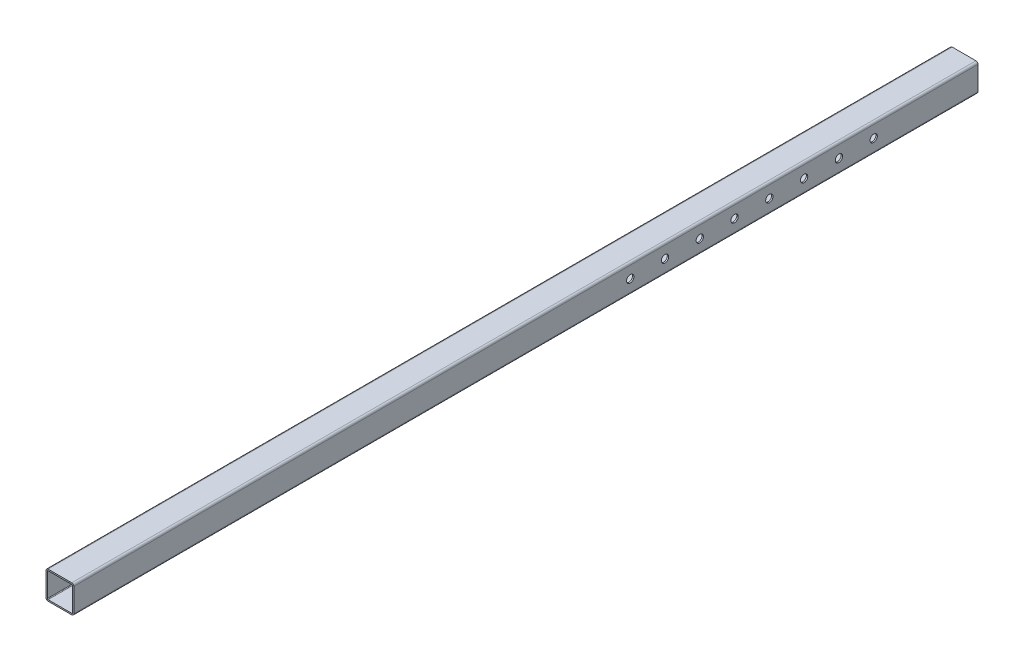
ISO-10303-21;
HEADER;
FILE_DESCRIPTION(('STEP AP214'),'2;1');
FILE_NAME('part.step','',(''),(''),'','','');
FILE_SCHEMA(('AUTOMOTIVE_DESIGN { 1 0 10303 214 1 1 1 1 }'));
ENDSEC;
DATA;
#1=APPLICATION_CONTEXT('core data for automotive mechanical design processes');
#2=APPLICATION_PROTOCOL_DEFINITION('international standard','automotive_design',2000,#1);
#3=PRODUCT_CONTEXT('',#1,'mechanical');
#4=PRODUCT('Part','Part','',(#3));
#5=PRODUCT_RELATED_PRODUCT_CATEGORY('part','',(#4));
#6=PRODUCT_DEFINITION_FORMATION('','',#4);
#7=PRODUCT_DEFINITION_CONTEXT('part definition',#1,'design');
#8=PRODUCT_DEFINITION('design','',#6,#7);
#9=PRODUCT_DEFINITION_SHAPE('','',#8);
#10=(LENGTH_UNIT() NAMED_UNIT(*) SI_UNIT(.MILLI.,.METRE.));
#11=(NAMED_UNIT(*) PLANE_ANGLE_UNIT() SI_UNIT($,.RADIAN.));
#12=(NAMED_UNIT(*) SI_UNIT($,.STERADIAN.) SOLID_ANGLE_UNIT());
#13=UNCERTAINTY_MEASURE_WITH_UNIT(LENGTH_MEASURE(1.E-05),#10,'distance_accuracy_value','');
#14=(GEOMETRIC_REPRESENTATION_CONTEXT(3) GLOBAL_UNCERTAINTY_ASSIGNED_CONTEXT((#13)) GLOBAL_UNIT_ASSIGNED_CONTEXT((#10,
#11,#12)) REPRESENTATION_CONTEXT('',''));
#15=CARTESIAN_POINT('',(0.,0.,0.));
#16=DIRECTION('',(0.,0.,1.));
#17=DIRECTION('',(1.,0.,0.));
#18=AXIS2_PLACEMENT_3D('',#15,#16,#17);
#19=CARTESIAN_POINT('',(3.,37.,-1300.));
#20=DIRECTION('',(0.,0.,1.));
#21=DIRECTION('',(1.,0.,0.));
#22=AXIS2_PLACEMENT_3D('',#19,#20,#21);
#23=CYLINDRICAL_SURFACE('',#22,3.);
#24=CARTESIAN_POINT('',(3.,37.,0.));
#25=DIRECTION('',(0.,0.,1.));
#26=DIRECTION('',(1.,0.,0.));
#27=AXIS2_PLACEMENT_3D('',#24,#25,#26);
#28=CIRCLE('',#27,3.);
#29=CARTESIAN_POINT('',(3.,40.,0.));
#30=VERTEX_POINT('',#29);
#31=CARTESIAN_POINT('',(0.,37.,0.));
#32=VERTEX_POINT('',#31);
#33=EDGE_CURVE('E521',#30,#32,#28,.T.);
#34=ORIENTED_EDGE('',*,*,#33,.F.);
#35=DIRECTION('',(0.,0.,1.));
#36=VECTOR('',#35,1.);
#37=CARTESIAN_POINT('',(3.,40.,-1300.));
#38=LINE('',#37,#36);
#39=CARTESIAN_POINT('',(3.,40.,-1300.));
#40=VERTEX_POINT('',#39);
#41=EDGE_CURVE('E580',#40,#30,#38,.T.);
#42=ORIENTED_EDGE('',*,*,#41,.F.);
#43=CARTESIAN_POINT('',(3.,37.,-1300.));
#44=DIRECTION('',(0.,0.,1.));
#45=DIRECTION('',(1.,0.,0.));
#46=AXIS2_PLACEMENT_3D('',#43,#44,#45);
#47=CIRCLE('',#46,3.);
#48=CARTESIAN_POINT('',(0.,37.,-1300.));
#49=VERTEX_POINT('',#48);
#50=EDGE_CURVE('E555',#40,#49,#47,.T.);
#51=ORIENTED_EDGE('',*,*,#50,.T.);
#52=DIRECTION('',(0.,0.,1.));
#53=VECTOR('',#52,1.);
#54=CARTESIAN_POINT('',(0.,37.,-1300.));
#55=LINE('',#54,#53);
#56=EDGE_CURVE('E579',#49,#32,#55,.T.);
#57=ORIENTED_EDGE('',*,*,#56,.T.);
#58=EDGE_LOOP('',(#34,#42,#51,#57));
#59=FACE_BOUND('',#58,.T.);
#60=ADVANCED_FACE('F348',(#59),#23,.T.);
#61=CARTESIAN_POINT('',(3.,40.,-1300.));
#62=DIRECTION('',(0.,1.,0.));
#63=DIRECTION('',(-1.,0.,0.));
#64=AXIS2_PLACEMENT_3D('',#61,#62,#63);
#65=PLANE('',#64);
#66=DIRECTION('',(-1.,0.,0.));
#67=VECTOR('',#66,1.);
#68=CARTESIAN_POINT('',(3.,40.,0.));
#69=LINE('',#68,#67);
#70=CARTESIAN_POINT('',(37.,40.,0.));
#71=VERTEX_POINT('',#70);
#72=EDGE_CURVE('E552',#71,#30,#69,.T.);
#73=ORIENTED_EDGE('',*,*,#72,.F.);
#74=DIRECTION('',(0.,0.,1.));
#75=VECTOR('',#74,1.);
#76=CARTESIAN_POINT('',(37.,40.,-1300.));
#77=LINE('',#76,#75);
#78=CARTESIAN_POINT('',(37.,40.,-1300.));
#79=VERTEX_POINT('',#78);
#80=EDGE_CURVE('E583',#79,#71,#77,.T.);
#81=ORIENTED_EDGE('',*,*,#80,.F.);
#82=DIRECTION('',(-1.,0.,0.));
#83=VECTOR('',#82,1.);
#84=CARTESIAN_POINT('',(3.,40.,-1300.));
#85=LINE('',#84,#83);
#86=EDGE_CURVE('E576',#79,#40,#85,.T.);
#87=ORIENTED_EDGE('',*,*,#86,.T.);
#88=ORIENTED_EDGE('',*,*,#41,.T.);
#89=EDGE_LOOP('',(#73,#81,#87,#88));
#90=FACE_BOUND('',#89,.T.);
#91=ADVANCED_FACE('F692',(#90),#65,.T.);
#92=CARTESIAN_POINT('',(37.,37.,-1300.));
#93=DIRECTION('',(0.,0.,1.));
#94=DIRECTION('',(1.,0.,0.));
#95=AXIS2_PLACEMENT_3D('',#92,#93,#94);
#96=CYLINDRICAL_SURFACE('',#95,3.);
#97=CARTESIAN_POINT('',(37.,37.,0.));
#98=DIRECTION('',(0.,0.,1.));
#99=DIRECTION('',(1.,0.,0.));
#100=AXIS2_PLACEMENT_3D('',#97,#98,#99);
#101=CIRCLE('',#100,3.);
#102=CARTESIAN_POINT('',(40.,37.,0.));
#103=VERTEX_POINT('',#102);
#104=EDGE_CURVE('E549',#103,#71,#101,.T.);
#105=ORIENTED_EDGE('',*,*,#104,.F.);
#106=DIRECTION('',(0.,0.,1.));
#107=VECTOR('',#106,1.);
#108=CARTESIAN_POINT('',(40.,37.,-1300.));
#109=LINE('',#108,#107);
#110=CARTESIAN_POINT('',(40.,37.,-1300.));
#111=VERTEX_POINT('',#110);
#112=EDGE_CURVE('E585',#111,#103,#109,.T.);
#113=ORIENTED_EDGE('',*,*,#112,.F.);
#114=CARTESIAN_POINT('',(37.,37.,-1300.));
#115=DIRECTION('',(0.,0.,1.));
#116=DIRECTION('',(1.,0.,0.));
#117=AXIS2_PLACEMENT_3D('',#114,#115,#116);
#118=CIRCLE('',#117,3.);
#119=EDGE_CURVE('E573',#111,#79,#118,.T.);
#120=ORIENTED_EDGE('',*,*,#119,.T.);
#121=ORIENTED_EDGE('',*,*,#80,.T.);
#122=EDGE_LOOP('',(#105,#113,#120,#121));
#123=FACE_BOUND('',#122,.T.);
#124=ADVANCED_FACE('F698',(#123),#96,.T.);
#125=CARTESIAN_POINT('',(40.,3.,-1300.));
#126=DIRECTION('',(1.,0.,0.));
#127=DIRECTION('',(0.,0.,-1.));
#128=AXIS2_PLACEMENT_3D('',#125,#126,#127);
#129=PLANE('',#128);
#130=CARTESIAN_POINT('',(40.,19.9999999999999,-850.000000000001));
#131=DIRECTION('',(1.,0.,0.));
#132=DIRECTION('',(0.,0.,-1.));
#133=AXIS2_PLACEMENT_3D('',#130,#131,#132);
#134=CIRCLE('',#133,5.24999999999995);
#135=CARTESIAN_POINT('',(40.,19.9999999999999,-855.25));
#136=VERTEX_POINT('',#135);
#137=EDGE_CURVE('E875',#136,#136,#134,.T.);
#138=ORIENTED_EDGE('',*,*,#137,.F.);
#139=EDGE_LOOP('',(#138));
#140=FACE_BOUND('',#139,.T.);
#141=CARTESIAN_POINT('',(40.,19.9999999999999,-800.));
#142=DIRECTION('',(1.,0.,0.));
#143=DIRECTION('',(0.,0.,-1.));
#144=AXIS2_PLACEMENT_3D('',#141,#142,#143);
#145=CIRCLE('',#144,5.24999999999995);
#146=CARTESIAN_POINT('',(40.,19.9999999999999,-805.25));
#147=VERTEX_POINT('',#146);
#148=EDGE_CURVE('E869',#147,#147,#145,.T.);
#149=ORIENTED_EDGE('',*,*,#148,.F.);
#150=EDGE_LOOP('',(#149));
#151=FACE_BOUND('',#150,.T.);
#152=DIRECTION('',(0.,1.,0.));
#153=VECTOR('',#152,1.);
#154=CARTESIAN_POINT('',(40.,3.,0.));
#155=LINE('',#154,#153);
#156=CARTESIAN_POINT('',(40.,3.,0.));
#157=VERTEX_POINT('',#156);
#158=EDGE_CURVE('E546',#157,#103,#155,.T.);
#159=ORIENTED_EDGE('',*,*,#158,.F.);
#160=DIRECTION('',(0.,0.,1.));
#161=VECTOR('',#160,1.);
#162=CARTESIAN_POINT('',(40.,3.,-1300.));
#163=LINE('',#162,#161);
#164=CARTESIAN_POINT('',(40.,3.,-1300.));
#165=VERTEX_POINT('',#164);
#166=EDGE_CURVE('E587',#165,#157,#163,.T.);
#167=ORIENTED_EDGE('',*,*,#166,.F.);
#168=DIRECTION('',(0.,1.,0.));
#169=VECTOR('',#168,1.);
#170=CARTESIAN_POINT('',(40.,3.,-1300.));
#171=LINE('',#170,#169);
#172=EDGE_CURVE('E570',#165,#111,#171,.T.);
#173=ORIENTED_EDGE('',*,*,#172,.T.);
#174=ORIENTED_EDGE('',*,*,#112,.T.);
#175=EDGE_LOOP('',(#159,#167,#173,#174));
#176=FACE_BOUND('',#175,.T.);
#177=CARTESIAN_POINT('',(40.,19.9999999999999,-900.000000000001));
#178=DIRECTION('',(1.,0.,0.));
#179=DIRECTION('',(0.,0.,-1.));
#180=AXIS2_PLACEMENT_3D('',#177,#178,#179);
#181=CIRCLE('',#180,5.24999999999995);
#182=CARTESIAN_POINT('',(40.,19.9999999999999,-905.250000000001));
#183=VERTEX_POINT('',#182);
#184=EDGE_CURVE('E582',#183,#183,#181,.T.);
#185=ORIENTED_EDGE('',*,*,#184,.F.);
#186=EDGE_LOOP('',(#185));
#187=FACE_BOUND('',#186,.T.);
#188=CARTESIAN_POINT('',(40.,19.9999999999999,-950.));
#189=DIRECTION('',(1.,0.,0.));
#190=DIRECTION('',(0.,0.,-1.));
#191=AXIS2_PLACEMENT_3D('',#188,#189,#190);
#192=CIRCLE('',#191,5.24999999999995);
#193=CARTESIAN_POINT('',(40.,19.9999999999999,-955.25));
#194=VERTEX_POINT('',#193);
#195=EDGE_CURVE('E606',#194,#194,#192,.T.);
#196=ORIENTED_EDGE('',*,*,#195,.F.);
#197=EDGE_LOOP('',(#196));
#198=FACE_BOUND('',#197,.T.);
#199=CARTESIAN_POINT('',(40.,19.9999999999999,-1000.));
#200=DIRECTION('',(1.,0.,0.));
#201=DIRECTION('',(0.,0.,-1.));
#202=AXIS2_PLACEMENT_3D('',#199,#200,#201);
#203=CIRCLE('',#202,5.24999999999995);
#204=CARTESIAN_POINT('',(40.,19.9999999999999,-1005.25));
#205=VERTEX_POINT('',#204);
#206=EDGE_CURVE('E612',#205,#205,#203,.T.);
#207=ORIENTED_EDGE('',*,*,#206,.F.);
#208=EDGE_LOOP('',(#207));
#209=FACE_BOUND('',#208,.T.);
#210=CARTESIAN_POINT('',(40.,19.9999999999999,-1050.));
#211=DIRECTION('',(1.,0.,0.));
#212=DIRECTION('',(0.,0.,-1.));
#213=AXIS2_PLACEMENT_3D('',#210,#211,#212);
#214=CIRCLE('',#213,5.24999999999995);
#215=CARTESIAN_POINT('',(40.,19.9999999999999,-1055.25));
#216=VERTEX_POINT('',#215);
#217=EDGE_CURVE('E618',#216,#216,#214,.T.);
#218=ORIENTED_EDGE('',*,*,#217,.F.);
#219=EDGE_LOOP('',(#218));
#220=FACE_BOUND('',#219,.T.);
#221=CARTESIAN_POINT('',(40.,19.9999999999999,-1100.));
#222=DIRECTION('',(1.,0.,0.));
#223=DIRECTION('',(0.,0.,-1.));
#224=AXIS2_PLACEMENT_3D('',#221,#222,#223);
#225=CIRCLE('',#224,5.24999999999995);
#226=CARTESIAN_POINT('',(40.,19.9999999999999,-1105.25));
#227=VERTEX_POINT('',#226);
#228=EDGE_CURVE('E624',#227,#227,#225,.T.);
#229=ORIENTED_EDGE('',*,*,#228,.F.);
#230=EDGE_LOOP('',(#229));
#231=FACE_BOUND('',#230,.T.);
#232=CARTESIAN_POINT('',(40.,19.9999999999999,-1150.));
#233=DIRECTION('',(1.,0.,0.));
#234=DIRECTION('',(0.,0.,-1.));
#235=AXIS2_PLACEMENT_3D('',#232,#233,#234);
#236=CIRCLE('',#235,5.24999999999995);
#237=CARTESIAN_POINT('',(40.,19.9999999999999,-1155.25));
#238=VERTEX_POINT('',#237);
#239=EDGE_CURVE('E630',#238,#238,#236,.T.);
#240=ORIENTED_EDGE('',*,*,#239,.F.);
#241=EDGE_LOOP('',(#240));
#242=FACE_BOUND('',#241,.T.);
#243=ADVANCED_FACE('F808',(#140,#151,#176,#187,#198,#209,#220,#231,#242),#129,.T.);
#244=CARTESIAN_POINT('',(37.,3.,-1300.));
#245=DIRECTION('',(0.,0.,1.));
#246=DIRECTION('',(1.,0.,0.));
#247=AXIS2_PLACEMENT_3D('',#244,#245,#246);
#248=CYLINDRICAL_SURFACE('',#247,2.99999999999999);
#249=CARTESIAN_POINT('',(37.,3.,0.));
#250=DIRECTION('',(0.,0.,1.));
#251=DIRECTION('',(-1.,0.,0.));
#252=AXIS2_PLACEMENT_3D('',#249,#250,#251);
#253=CIRCLE('',#252,2.99999999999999);
#254=CARTESIAN_POINT('',(37.,0.,0.));
#255=VERTEX_POINT('',#254);
#256=EDGE_CURVE('E543',#255,#157,#253,.T.);
#257=ORIENTED_EDGE('',*,*,#256,.F.);
#258=DIRECTION('',(0.,0.,1.));
#259=VECTOR('',#258,1.);
#260=CARTESIAN_POINT('',(37.,0.,-1300.));
#261=LINE('',#260,#259);
#262=CARTESIAN_POINT('',(37.,0.,-1300.));
#263=VERTEX_POINT('',#262);
#264=EDGE_CURVE('E589',#263,#255,#261,.T.);
#265=ORIENTED_EDGE('',*,*,#264,.F.);
#266=CARTESIAN_POINT('',(37.,3.,-1300.));
#267=DIRECTION('',(0.,0.,1.));
#268=DIRECTION('',(-1.,0.,0.));
#269=AXIS2_PLACEMENT_3D('',#266,#267,#268);
#270=CIRCLE('',#269,2.99999999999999);
#271=EDGE_CURVE('E567',#263,#165,#270,.T.);
#272=ORIENTED_EDGE('',*,*,#271,.T.);
#273=ORIENTED_EDGE('',*,*,#166,.T.);
#274=EDGE_LOOP('',(#257,#265,#272,#273));
#275=FACE_BOUND('',#274,.T.);
#276=ADVANCED_FACE('F812',(#275),#248,.T.);
#277=CARTESIAN_POINT('',(3.00000000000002,0.,-1300.));
#278=DIRECTION('',(0.,-1.,0.));
#279=DIRECTION('',(0.,0.,-1.));
#280=AXIS2_PLACEMENT_3D('',#277,#278,#279);
#281=PLANE('',#280);
#282=DIRECTION('',(1.,0.,0.));
#283=VECTOR('',#282,1.);
#284=CARTESIAN_POINT('',(3.00000000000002,0.,0.));
#285=LINE('',#284,#283);
#286=CARTESIAN_POINT('',(3.00000000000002,0.,0.));
#287=VERTEX_POINT('',#286);
#288=EDGE_CURVE('E540',#287,#255,#285,.T.);
#289=ORIENTED_EDGE('',*,*,#288,.F.);
#290=DIRECTION('',(0.,0.,1.));
#291=VECTOR('',#290,1.);
#292=CARTESIAN_POINT('',(3.00000000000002,0.,-1300.));
#293=LINE('',#292,#291);
#294=CARTESIAN_POINT('',(3.00000000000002,0.,-1300.));
#295=VERTEX_POINT('',#294);
#296=EDGE_CURVE('E591',#295,#287,#293,.T.);
#297=ORIENTED_EDGE('',*,*,#296,.F.);
#298=DIRECTION('',(1.,0.,0.));
#299=VECTOR('',#298,1.);
#300=CARTESIAN_POINT('',(3.00000000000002,0.,-1300.));
#301=LINE('',#300,#299);
#302=EDGE_CURVE('E564',#295,#263,#301,.T.);
#303=ORIENTED_EDGE('',*,*,#302,.T.);
#304=ORIENTED_EDGE('',*,*,#264,.T.);
#305=EDGE_LOOP('',(#289,#297,#303,#304));
#306=FACE_BOUND('',#305,.T.);
#307=ADVANCED_FACE('F765',(#306),#281,.T.);
#308=CARTESIAN_POINT('',(3.,3.,-1300.));
#309=DIRECTION('',(0.,0.,1.));
#310=DIRECTION('',(1.,0.,0.));
#311=AXIS2_PLACEMENT_3D('',#308,#309,#310);
#312=CYLINDRICAL_SURFACE('',#311,3.);
#313=CARTESIAN_POINT('',(3.,3.,0.));
#314=DIRECTION('',(0.,0.,1.));
#315=DIRECTION('',(1.,0.,0.));
#316=AXIS2_PLACEMENT_3D('',#313,#314,#315);
#317=CIRCLE('',#316,3.);
#318=CARTESIAN_POINT('',(0.,3.,0.));
#319=VERTEX_POINT('',#318);
#320=EDGE_CURVE('E537',#319,#287,#317,.T.);
#321=ORIENTED_EDGE('',*,*,#320,.F.);
#322=DIRECTION('',(0.,0.,1.));
#323=VECTOR('',#322,1.);
#324=CARTESIAN_POINT('',(0.,3.,-1300.));
#325=LINE('',#324,#323);
#326=CARTESIAN_POINT('',(0.,3.,-1300.));
#327=VERTEX_POINT('',#326);
#328=EDGE_CURVE('E593',#327,#319,#325,.T.);
#329=ORIENTED_EDGE('',*,*,#328,.F.);
#330=CARTESIAN_POINT('',(3.,3.,-1300.));
#331=DIRECTION('',(0.,0.,1.));
#332=DIRECTION('',(1.,0.,0.));
#333=AXIS2_PLACEMENT_3D('',#330,#331,#332);
#334=CIRCLE('',#333,3.);
#335=EDGE_CURVE('E561',#327,#295,#334,.T.);
#336=ORIENTED_EDGE('',*,*,#335,.T.);
#337=ORIENTED_EDGE('',*,*,#296,.T.);
#338=EDGE_LOOP('',(#321,#329,#336,#337));
#339=FACE_BOUND('',#338,.T.);
#340=ADVANCED_FACE('F757',(#339),#312,.T.);
#341=CARTESIAN_POINT('',(0.,3.,-1300.));
#342=DIRECTION('',(-1.,0.,0.));
#343=DIRECTION('',(0.,-1.,0.));
#344=AXIS2_PLACEMENT_3D('',#341,#342,#343);
#345=PLANE('',#344);
#346=CARTESIAN_POINT('',(0.,19.9999999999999,-850.000000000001));
#347=DIRECTION('',(1.,0.,0.));
#348=DIRECTION('',(0.,0.,-1.));
#349=AXIS2_PLACEMENT_3D('',#346,#347,#348);
#350=CIRCLE('',#349,5.24999999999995);
#351=CARTESIAN_POINT('',(0.,19.9999999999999,-855.25));
#352=VERTEX_POINT('',#351);
#353=EDGE_CURVE('E770',#352,#352,#350,.T.);
#354=ORIENTED_EDGE('',*,*,#353,.T.);
#355=EDGE_LOOP('',(#354));
#356=FACE_BOUND('',#355,.T.);
#357=CARTESIAN_POINT('',(0.,19.9999999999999,-800.));
#358=DIRECTION('',(1.,0.,0.));
#359=DIRECTION('',(0.,0.,-1.));
#360=AXIS2_PLACEMENT_3D('',#357,#358,#359);
#361=CIRCLE('',#360,5.24999999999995);
#362=CARTESIAN_POINT('',(0.,19.9999999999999,-805.25));
#363=VERTEX_POINT('',#362);
#364=EDGE_CURVE('E600',#363,#363,#361,.T.);
#365=ORIENTED_EDGE('',*,*,#364,.T.);
#366=EDGE_LOOP('',(#365));
#367=FACE_BOUND('',#366,.T.);
#368=DIRECTION('',(0.,-1.,0.));
#369=VECTOR('',#368,1.);
#370=CARTESIAN_POINT('',(0.,3.,0.));
#371=LINE('',#370,#369);
#372=EDGE_CURVE('E534',#32,#319,#371,.T.);
#373=ORIENTED_EDGE('',*,*,#372,.F.);
#374=ORIENTED_EDGE('',*,*,#56,.F.);
#375=DIRECTION('',(0.,-1.,0.));
#376=VECTOR('',#375,1.);
#377=CARTESIAN_POINT('',(0.,3.,-1300.));
#378=LINE('',#377,#376);
#379=EDGE_CURVE('E558',#49,#327,#378,.T.);
#380=ORIENTED_EDGE('',*,*,#379,.T.);
#381=ORIENTED_EDGE('',*,*,#328,.T.);
#382=EDGE_LOOP('',(#373,#374,#380,#381));
#383=FACE_BOUND('',#382,.T.);
#384=CARTESIAN_POINT('',(0.,19.9999999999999,-900.000000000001));
#385=DIRECTION('',(1.,0.,0.));
#386=DIRECTION('',(0.,0.,-1.));
#387=AXIS2_PLACEMENT_3D('',#384,#385,#386);
#388=CIRCLE('',#387,5.24999999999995);
#389=CARTESIAN_POINT('',(0.,19.9999999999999,-905.250000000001));
#390=VERTEX_POINT('',#389);
#391=EDGE_CURVE('E636',#390,#390,#388,.T.);
#392=ORIENTED_EDGE('',*,*,#391,.T.);
#393=EDGE_LOOP('',(#392));
#394=FACE_BOUND('',#393,.T.);
#395=CARTESIAN_POINT('',(0.,19.9999999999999,-950.));
#396=DIRECTION('',(1.,0.,0.));
#397=DIRECTION('',(0.,0.,-1.));
#398=AXIS2_PLACEMENT_3D('',#395,#396,#397);
#399=CIRCLE('',#398,5.24999999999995);
#400=CARTESIAN_POINT('',(0.,19.9999999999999,-955.25));
#401=VERTEX_POINT('',#400);
#402=EDGE_CURVE('E642',#401,#401,#399,.T.);
#403=ORIENTED_EDGE('',*,*,#402,.T.);
#404=EDGE_LOOP('',(#403));
#405=FACE_BOUND('',#404,.T.);
#406=CARTESIAN_POINT('',(0.,19.9999999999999,-1000.));
#407=DIRECTION('',(1.,0.,0.));
#408=DIRECTION('',(0.,0.,-1.));
#409=AXIS2_PLACEMENT_3D('',#406,#407,#408);
#410=CIRCLE('',#409,5.24999999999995);
#411=CARTESIAN_POINT('',(0.,19.9999999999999,-1005.25));
#412=VERTEX_POINT('',#411);
#413=EDGE_CURVE('E648',#412,#412,#410,.T.);
#414=ORIENTED_EDGE('',*,*,#413,.T.);
#415=EDGE_LOOP('',(#414));
#416=FACE_BOUND('',#415,.T.);
#417=CARTESIAN_POINT('',(0.,19.9999999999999,-1050.));
#418=DIRECTION('',(1.,0.,0.));
#419=DIRECTION('',(0.,0.,-1.));
#420=AXIS2_PLACEMENT_3D('',#417,#418,#419);
#421=CIRCLE('',#420,5.24999999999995);
#422=CARTESIAN_POINT('',(0.,19.9999999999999,-1055.25));
#423=VERTEX_POINT('',#422);
#424=EDGE_CURVE('E654',#423,#423,#421,.T.);
#425=ORIENTED_EDGE('',*,*,#424,.T.);
#426=EDGE_LOOP('',(#425));
#427=FACE_BOUND('',#426,.T.);
#428=CARTESIAN_POINT('',(0.,19.9999999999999,-1100.));
#429=DIRECTION('',(1.,0.,0.));
#430=DIRECTION('',(0.,0.,-1.));
#431=AXIS2_PLACEMENT_3D('',#428,#429,#430);
#432=CIRCLE('',#431,5.24999999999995);
#433=CARTESIAN_POINT('',(0.,19.9999999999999,-1105.25));
#434=VERTEX_POINT('',#433);
#435=EDGE_CURVE('E660',#434,#434,#432,.T.);
#436=ORIENTED_EDGE('',*,*,#435,.T.);
#437=EDGE_LOOP('',(#436));
#438=FACE_BOUND('',#437,.T.);
#439=CARTESIAN_POINT('',(0.,19.9999999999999,-1150.));
#440=DIRECTION('',(1.,0.,0.));
#441=DIRECTION('',(0.,0.,-1.));
#442=AXIS2_PLACEMENT_3D('',#439,#440,#441);
#443=CIRCLE('',#442,5.24999999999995);
#444=CARTESIAN_POINT('',(0.,19.9999999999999,-1155.25));
#445=VERTEX_POINT('',#444);
#446=EDGE_CURVE('E356',#445,#445,#443,.T.);
#447=ORIENTED_EDGE('',*,*,#446,.T.);
#448=EDGE_LOOP('',(#447));
#449=FACE_BOUND('',#448,.T.);
#450=ADVANCED_FACE('F668',(#356,#367,#383,#394,#405,#416,#427,#438,#449),#345,.T.);
#451=CARTESIAN_POINT('',(3.,37.,-1300.));
#452=DIRECTION('',(0.,0.,1.));
#453=DIRECTION('',(1.,0.,0.));
#454=AXIS2_PLACEMENT_3D('',#451,#452,#453);
#455=PLANE('',#454);
#456=DIRECTION('',(-1.,0.,0.));
#457=VECTOR('',#456,1.);
#458=CARTESIAN_POINT('',(3.,38.,-1300.));
#459=LINE('',#458,#457);
#460=CARTESIAN_POINT('',(37.,38.,-1300.));
#461=VERTEX_POINT('',#460);
#462=CARTESIAN_POINT('',(3.,38.,-1300.));
#463=VERTEX_POINT('',#462);
#464=EDGE_CURVE('E516',#461,#463,#459,.T.);
#465=ORIENTED_EDGE('',*,*,#464,.T.);
#466=CARTESIAN_POINT('',(3.,37.,-1300.));
#467=DIRECTION('',(0.,0.,1.));
#468=DIRECTION('',(-1.,0.,0.));
#469=AXIS2_PLACEMENT_3D('',#466,#467,#468);
#470=CIRCLE('',#469,0.999999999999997);
#471=CARTESIAN_POINT('',(2.,37.,-1300.));
#472=VERTEX_POINT('',#471);
#473=EDGE_CURVE('E498',#463,#472,#470,.T.);
#474=ORIENTED_EDGE('',*,*,#473,.T.);
#475=DIRECTION('',(0.,-1.,0.));
#476=VECTOR('',#475,1.);
#477=CARTESIAN_POINT('',(2.,37.,-1300.));
#478=LINE('',#477,#476);
#479=CARTESIAN_POINT('',(2.00000000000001,3.,-1300.));
#480=VERTEX_POINT('',#479);
#481=EDGE_CURVE('E501',#472,#480,#478,.T.);
#482=ORIENTED_EDGE('',*,*,#481,.T.);
#483=CARTESIAN_POINT('',(3.00000000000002,3.,-1300.));
#484=DIRECTION('',(0.,0.,1.));
#485=DIRECTION('',(-1.,0.,0.));
#486=AXIS2_PLACEMENT_3D('',#483,#484,#485);
#487=CIRCLE('',#486,1.);
#488=CARTESIAN_POINT('',(3.00000000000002,2.,-1300.));
#489=VERTEX_POINT('',#488);
#490=EDGE_CURVE('E363',#480,#489,#487,.T.);
#491=ORIENTED_EDGE('',*,*,#490,.T.);
#492=DIRECTION('',(1.,0.,0.));
#493=VECTOR('',#492,1.);
#494=CARTESIAN_POINT('',(3.00000000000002,2.,-1300.));
#495=LINE('',#494,#493);
#496=CARTESIAN_POINT('',(37.,2.,-1300.));
#497=VERTEX_POINT('',#496);
#498=EDGE_CURVE('E504',#489,#497,#495,.T.);
#499=ORIENTED_EDGE('',*,*,#498,.T.);
#500=CARTESIAN_POINT('',(37.,3.,-1300.));
#501=DIRECTION('',(0.,0.,1.));
#502=DIRECTION('',(-1.,0.,0.));
#503=AXIS2_PLACEMENT_3D('',#500,#501,#502);
#504=CIRCLE('',#503,1.);
#505=CARTESIAN_POINT('',(38.,3.,-1300.));
#506=VERTEX_POINT('',#505);
#507=EDGE_CURVE('E507',#497,#506,#504,.T.);
#508=ORIENTED_EDGE('',*,*,#507,.T.);
#509=DIRECTION('',(0.,1.,0.));
#510=VECTOR('',#509,1.);
#511=CARTESIAN_POINT('',(38.,37.,-1300.));
#512=LINE('',#511,#510);
#513=CARTESIAN_POINT('',(38.,37.,-1300.));
#514=VERTEX_POINT('',#513);
#515=EDGE_CURVE('E510',#506,#514,#512,.T.);
#516=ORIENTED_EDGE('',*,*,#515,.T.);
#517=CARTESIAN_POINT('',(37.,37.,-1300.));
#518=DIRECTION('',(0.,0.,1.));
#519=DIRECTION('',(1.,0.,0.));
#520=AXIS2_PLACEMENT_3D('',#517,#518,#519);
#521=CIRCLE('',#520,1.);
#522=EDGE_CURVE('E513',#514,#461,#521,.T.);
#523=ORIENTED_EDGE('',*,*,#522,.T.);
#524=EDGE_LOOP('',(#465,#474,#482,#491,#499,#508,#516,#523));
#525=FACE_BOUND('',#524,.T.);
#526=ORIENTED_EDGE('',*,*,#50,.F.);
#527=ORIENTED_EDGE('',*,*,#86,.F.);
#528=ORIENTED_EDGE('',*,*,#119,.F.);
#529=ORIENTED_EDGE('',*,*,#172,.F.);
#530=ORIENTED_EDGE('',*,*,#271,.F.);
#531=ORIENTED_EDGE('',*,*,#302,.F.);
#532=ORIENTED_EDGE('',*,*,#335,.F.);
#533=ORIENTED_EDGE('',*,*,#379,.F.);
#534=EDGE_LOOP('',(#526,#527,#528,#529,#530,#531,#532,#533));
#535=FACE_BOUND('',#534,.T.);
#536=ADVANCED_FACE('F756',(#525,#535),#455,.F.);
#537=CARTESIAN_POINT('',(3.,37.,0.));
#538=DIRECTION('',(0.,0.,1.));
#539=DIRECTION('',(1.,0.,0.));
#540=AXIS2_PLACEMENT_3D('',#537,#538,#539);
#541=PLANE('',#540);
#542=CARTESIAN_POINT('',(3.,37.,0.));
#543=DIRECTION('',(0.,0.,1.));
#544=DIRECTION('',(-1.,0.,0.));
#545=AXIS2_PLACEMENT_3D('',#542,#543,#544);
#546=CIRCLE('',#545,0.999999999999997);
#547=CARTESIAN_POINT('',(3.,38.,0.));
#548=VERTEX_POINT('',#547);
#549=CARTESIAN_POINT('',(2.,37.,0.));
#550=VERTEX_POINT('',#549);
#551=EDGE_CURVE('E371',#548,#550,#546,.T.);
#552=ORIENTED_EDGE('',*,*,#551,.F.);
#553=DIRECTION('',(-1.,0.,0.));
#554=VECTOR('',#553,1.);
#555=CARTESIAN_POINT('',(3.,38.,0.));
#556=LINE('',#555,#554);
#557=CARTESIAN_POINT('',(37.,38.,0.));
#558=VERTEX_POINT('',#557);
#559=EDGE_CURVE('E495',#558,#548,#556,.T.);
#560=ORIENTED_EDGE('',*,*,#559,.F.);
#561=CARTESIAN_POINT('',(37.,37.,0.));
#562=DIRECTION('',(0.,0.,1.));
#563=DIRECTION('',(1.,0.,0.));
#564=AXIS2_PLACEMENT_3D('',#561,#562,#563);
#565=CIRCLE('',#564,1.);
#566=CARTESIAN_POINT('',(38.,37.,0.));
#567=VERTEX_POINT('',#566);
#568=EDGE_CURVE('E492',#567,#558,#565,.T.);
#569=ORIENTED_EDGE('',*,*,#568,.F.);
#570=DIRECTION('',(0.,1.,0.));
#571=VECTOR('',#570,1.);
#572=CARTESIAN_POINT('',(38.,37.,0.));
#573=LINE('',#572,#571);
#574=CARTESIAN_POINT('',(38.,3.,0.));
#575=VERTEX_POINT('',#574);
#576=EDGE_CURVE('E489',#575,#567,#573,.T.);
#577=ORIENTED_EDGE('',*,*,#576,.F.);
#578=CARTESIAN_POINT('',(37.,3.,0.));
#579=DIRECTION('',(0.,0.,1.));
#580=DIRECTION('',(-1.,0.,0.));
#581=AXIS2_PLACEMENT_3D('',#578,#579,#580);
#582=CIRCLE('',#581,1.);
#583=CARTESIAN_POINT('',(37.,2.,0.));
#584=VERTEX_POINT('',#583);
#585=EDGE_CURVE('E483',#584,#575,#582,.T.);
#586=ORIENTED_EDGE('',*,*,#585,.F.);
#587=DIRECTION('',(1.,0.,0.));
#588=VECTOR('',#587,1.);
#589=CARTESIAN_POINT('',(3.00000000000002,2.,0.));
#590=LINE('',#589,#588);
#591=CARTESIAN_POINT('',(3.00000000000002,2.,0.));
#592=VERTEX_POINT('',#591);
#593=EDGE_CURVE('E481',#592,#584,#590,.T.);
#594=ORIENTED_EDGE('',*,*,#593,.F.);
#595=CARTESIAN_POINT('',(3.00000000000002,3.,0.));
#596=DIRECTION('',(0.,0.,1.));
#597=DIRECTION('',(-1.,0.,0.));
#598=AXIS2_PLACEMENT_3D('',#595,#596,#597);
#599=CIRCLE('',#598,1.);
#600=CARTESIAN_POINT('',(2.00000000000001,3.,0.));
#601=VERTEX_POINT('',#600);
#602=EDGE_CURVE('E463',#601,#592,#599,.T.);
#603=ORIENTED_EDGE('',*,*,#602,.F.);
#604=DIRECTION('',(0.,-1.,0.));
#605=VECTOR('',#604,1.);
#606=CARTESIAN_POINT('',(2.,37.,0.));
#607=LINE('',#606,#605);
#608=EDGE_CURVE('E472',#550,#601,#607,.T.);
#609=ORIENTED_EDGE('',*,*,#608,.F.);
#610=EDGE_LOOP('',(#552,#560,#569,#577,#586,#594,#603,#609));
#611=FACE_BOUND('',#610,.T.);
#612=ORIENTED_EDGE('',*,*,#33,.T.);
#613=ORIENTED_EDGE('',*,*,#372,.T.);
#614=ORIENTED_EDGE('',*,*,#320,.T.);
#615=ORIENTED_EDGE('',*,*,#288,.T.);
#616=ORIENTED_EDGE('',*,*,#256,.T.);
#617=ORIENTED_EDGE('',*,*,#158,.T.);
#618=ORIENTED_EDGE('',*,*,#104,.T.);
#619=ORIENTED_EDGE('',*,*,#72,.T.);
#620=EDGE_LOOP('',(#612,#613,#614,#615,#616,#617,#618,#619));
#621=FACE_BOUND('',#620,.T.);
#622=ADVANCED_FACE('F477',(#611,#621),#541,.T.);
#623=CARTESIAN_POINT('',(3.,37.,-1300.));
#624=DIRECTION('',(0.,0.,1.));
#625=DIRECTION('',(1.,0.,0.));
#626=AXIS2_PLACEMENT_3D('',#623,#624,#625);
#627=CYLINDRICAL_SURFACE('',#626,0.999999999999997);
#628=ORIENTED_EDGE('',*,*,#551,.T.);
#629=DIRECTION('',(0.,0.,1.));
#630=VECTOR('',#629,1.);
#631=CARTESIAN_POINT('',(2.,37.,-1300.));
#632=LINE('',#631,#630);
#633=EDGE_CURVE('E469',#472,#550,#632,.T.);
#634=ORIENTED_EDGE('',*,*,#633,.F.);
#635=ORIENTED_EDGE('',*,*,#473,.F.);
#636=DIRECTION('',(0.,0.,1.));
#637=VECTOR('',#636,1.);
#638=CARTESIAN_POINT('',(3.,38.,-1300.));
#639=LINE('',#638,#637);
#640=EDGE_CURVE('E519',#463,#548,#639,.T.);
#641=ORIENTED_EDGE('',*,*,#640,.T.);
#642=EDGE_LOOP('',(#628,#634,#635,#641));
#643=FACE_BOUND('',#642,.T.);
#644=ADVANCED_FACE('F829',(#643),#627,.F.);
#645=CARTESIAN_POINT('',(3.,38.,-1300.));
#646=DIRECTION('',(0.,1.,0.));
#647=DIRECTION('',(-1.,0.,0.));
#648=AXIS2_PLACEMENT_3D('',#645,#646,#647);
#649=PLANE('',#648);
#650=ORIENTED_EDGE('',*,*,#559,.T.);
#651=ORIENTED_EDGE('',*,*,#640,.F.);
#652=ORIENTED_EDGE('',*,*,#464,.F.);
#653=DIRECTION('',(0.,0.,1.));
#654=VECTOR('',#653,1.);
#655=CARTESIAN_POINT('',(37.,38.,-1300.));
#656=LINE('',#655,#654);
#657=EDGE_CURVE('E522',#461,#558,#656,.T.);
#658=ORIENTED_EDGE('',*,*,#657,.T.);
#659=EDGE_LOOP('',(#650,#651,#652,#658));
#660=FACE_BOUND('',#659,.T.);
#661=ADVANCED_FACE('F831',(#660),#649,.F.);
#662=CARTESIAN_POINT('',(37.,37.,-1300.));
#663=DIRECTION('',(0.,0.,1.));
#664=DIRECTION('',(1.,0.,0.));
#665=AXIS2_PLACEMENT_3D('',#662,#663,#664);
#666=CYLINDRICAL_SURFACE('',#665,1.);
#667=ORIENTED_EDGE('',*,*,#568,.T.);
#668=ORIENTED_EDGE('',*,*,#657,.F.);
#669=ORIENTED_EDGE('',*,*,#522,.F.);
#670=DIRECTION('',(0.,0.,1.));
#671=VECTOR('',#670,1.);
#672=CARTESIAN_POINT('',(38.,37.,-1300.));
#673=LINE('',#672,#671);
#674=EDGE_CURVE('E524',#514,#567,#673,.T.);
#675=ORIENTED_EDGE('',*,*,#674,.T.);
#676=EDGE_LOOP('',(#667,#668,#669,#675));
#677=FACE_BOUND('',#676,.T.);
#678=ADVANCED_FACE('F835',(#677),#666,.F.);
#679=CARTESIAN_POINT('',(38.,37.,-1300.));
#680=DIRECTION('',(1.,0.,0.));
#681=DIRECTION('',(0.,1.,0.));
#682=AXIS2_PLACEMENT_3D('',#679,#680,#681);
#683=PLANE('',#682);
#684=CARTESIAN_POINT('',(38.,19.9999999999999,-850.000000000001));
#685=DIRECTION('',(1.,0.,0.));
#686=DIRECTION('',(0.,1.,0.));
#687=AXIS2_PLACEMENT_3D('',#684,#685,#686);
#688=CIRCLE('',#687,5.24999999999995);
#689=CARTESIAN_POINT('',(38.,19.9999999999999,-855.25));
#690=VERTEX_POINT('',#689);
#691=EDGE_CURVE('E872',#690,#690,#688,.T.);
#692=ORIENTED_EDGE('',*,*,#691,.T.);
#693=EDGE_LOOP('',(#692));
#694=FACE_BOUND('',#693,.T.);
#695=CARTESIAN_POINT('',(38.,19.9999999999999,-800.));
#696=DIRECTION('',(1.,0.,0.));
#697=DIRECTION('',(0.,1.,0.));
#698=AXIS2_PLACEMENT_3D('',#695,#696,#697);
#699=CIRCLE('',#698,5.24999999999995);
#700=CARTESIAN_POINT('',(38.,19.9999999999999,-805.25));
#701=VERTEX_POINT('',#700);
#702=EDGE_CURVE('E599',#701,#701,#699,.T.);
#703=ORIENTED_EDGE('',*,*,#702,.T.);
#704=EDGE_LOOP('',(#703));
#705=FACE_BOUND('',#704,.T.);
#706=ORIENTED_EDGE('',*,*,#576,.T.);
#707=ORIENTED_EDGE('',*,*,#674,.F.);
#708=ORIENTED_EDGE('',*,*,#515,.F.);
#709=DIRECTION('',(0.,0.,1.));
#710=VECTOR('',#709,1.);
#711=CARTESIAN_POINT('',(38.,3.,-1300.));
#712=LINE('',#711,#710);
#713=EDGE_CURVE('E526',#506,#575,#712,.T.);
#714=ORIENTED_EDGE('',*,*,#713,.T.);
#715=EDGE_LOOP('',(#706,#707,#708,#714));
#716=FACE_BOUND('',#715,.T.);
#717=CARTESIAN_POINT('',(38.,19.9999999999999,-900.000000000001));
#718=DIRECTION('',(1.,0.,0.));
#719=DIRECTION('',(0.,1.,0.));
#720=AXIS2_PLACEMENT_3D('',#717,#718,#719);
#721=CIRCLE('',#720,5.24999999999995);
#722=CARTESIAN_POINT('',(38.,19.9999999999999,-905.250000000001));
#723=VERTEX_POINT('',#722);
#724=EDGE_CURVE('E603',#723,#723,#721,.T.);
#725=ORIENTED_EDGE('',*,*,#724,.T.);
#726=EDGE_LOOP('',(#725));
#727=FACE_BOUND('',#726,.T.);
#728=CARTESIAN_POINT('',(38.,19.9999999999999,-950.));
#729=DIRECTION('',(1.,0.,0.));
#730=DIRECTION('',(0.,1.,0.));
#731=AXIS2_PLACEMENT_3D('',#728,#729,#730);
#732=CIRCLE('',#731,5.24999999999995);
#733=CARTESIAN_POINT('',(38.,19.9999999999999,-955.25));
#734=VERTEX_POINT('',#733);
#735=EDGE_CURVE('E609',#734,#734,#732,.T.);
#736=ORIENTED_EDGE('',*,*,#735,.T.);
#737=EDGE_LOOP('',(#736));
#738=FACE_BOUND('',#737,.T.);
#739=CARTESIAN_POINT('',(38.,19.9999999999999,-1000.));
#740=DIRECTION('',(1.,0.,0.));
#741=DIRECTION('',(0.,1.,0.));
#742=AXIS2_PLACEMENT_3D('',#739,#740,#741);
#743=CIRCLE('',#742,5.24999999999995);
#744=CARTESIAN_POINT('',(38.,19.9999999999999,-1005.25));
#745=VERTEX_POINT('',#744);
#746=EDGE_CURVE('E615',#745,#745,#743,.T.);
#747=ORIENTED_EDGE('',*,*,#746,.T.);
#748=EDGE_LOOP('',(#747));
#749=FACE_BOUND('',#748,.T.);
#750=CARTESIAN_POINT('',(38.,19.9999999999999,-1050.));
#751=DIRECTION('',(1.,0.,0.));
#752=DIRECTION('',(0.,1.,0.));
#753=AXIS2_PLACEMENT_3D('',#750,#751,#752);
#754=CIRCLE('',#753,5.24999999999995);
#755=CARTESIAN_POINT('',(38.,19.9999999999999,-1055.25));
#756=VERTEX_POINT('',#755);
#757=EDGE_CURVE('E621',#756,#756,#754,.T.);
#758=ORIENTED_EDGE('',*,*,#757,.T.);
#759=EDGE_LOOP('',(#758));
#760=FACE_BOUND('',#759,.T.);
#761=CARTESIAN_POINT('',(38.,19.9999999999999,-1100.));
#762=DIRECTION('',(1.,0.,0.));
#763=DIRECTION('',(0.,1.,0.));
#764=AXIS2_PLACEMENT_3D('',#761,#762,#763);
#765=CIRCLE('',#764,5.24999999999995);
#766=CARTESIAN_POINT('',(38.,19.9999999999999,-1105.25));
#767=VERTEX_POINT('',#766);
#768=EDGE_CURVE('E627',#767,#767,#765,.T.);
#769=ORIENTED_EDGE('',*,*,#768,.T.);
#770=EDGE_LOOP('',(#769));
#771=FACE_BOUND('',#770,.T.);
#772=CARTESIAN_POINT('',(38.,19.9999999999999,-1150.));
#773=DIRECTION('',(1.,0.,0.));
#774=DIRECTION('',(0.,1.,0.));
#775=AXIS2_PLACEMENT_3D('',#772,#773,#774);
#776=CIRCLE('',#775,5.24999999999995);
#777=CARTESIAN_POINT('',(38.,19.9999999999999,-1155.25));
#778=VERTEX_POINT('',#777);
#779=EDGE_CURVE('E633',#778,#778,#776,.T.);
#780=ORIENTED_EDGE('',*,*,#779,.T.);
#781=EDGE_LOOP('',(#780));
#782=FACE_BOUND('',#781,.T.);
#783=ADVANCED_FACE('F841',(#694,#705,#716,#727,#738,#749,#760,#771,#782),#683,.F.);
#784=CARTESIAN_POINT('',(37.,3.,-1300.));
#785=DIRECTION('',(0.,0.,1.));
#786=DIRECTION('',(1.,0.,0.));
#787=AXIS2_PLACEMENT_3D('',#784,#785,#786);
#788=CYLINDRICAL_SURFACE('',#787,1.);
#789=ORIENTED_EDGE('',*,*,#585,.T.);
#790=ORIENTED_EDGE('',*,*,#713,.F.);
#791=ORIENTED_EDGE('',*,*,#507,.F.);
#792=DIRECTION('',(0.,0.,1.));
#793=VECTOR('',#792,1.);
#794=CARTESIAN_POINT('',(37.,2.,-1300.));
#795=LINE('',#794,#793);
#796=EDGE_CURVE('E528',#497,#584,#795,.T.);
#797=ORIENTED_EDGE('',*,*,#796,.T.);
#798=EDGE_LOOP('',(#789,#790,#791,#797));
#799=FACE_BOUND('',#798,.T.);
#800=ADVANCED_FACE('F848',(#799),#788,.F.);
#801=CARTESIAN_POINT('',(3.00000000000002,2.,-1300.));
#802=DIRECTION('',(0.,-1.,0.));
#803=DIRECTION('',(0.,0.,-1.));
#804=AXIS2_PLACEMENT_3D('',#801,#802,#803);
#805=PLANE('',#804);
#806=ORIENTED_EDGE('',*,*,#593,.T.);
#807=ORIENTED_EDGE('',*,*,#796,.F.);
#808=ORIENTED_EDGE('',*,*,#498,.F.);
#809=DIRECTION('',(0.,0.,1.));
#810=VECTOR('',#809,1.);
#811=CARTESIAN_POINT('',(3.00000000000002,2.,-1300.));
#812=LINE('',#811,#810);
#813=EDGE_CURVE('E468',#489,#592,#812,.T.);
#814=ORIENTED_EDGE('',*,*,#813,.T.);
#815=EDGE_LOOP('',(#806,#807,#808,#814));
#816=FACE_BOUND('',#815,.T.);
#817=ADVANCED_FACE('F686',(#816),#805,.F.);
#818=CARTESIAN_POINT('',(3.00000000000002,3.,-1300.));
#819=DIRECTION('',(0.,0.,1.));
#820=DIRECTION('',(1.,0.,0.));
#821=AXIS2_PLACEMENT_3D('',#818,#819,#820);
#822=CYLINDRICAL_SURFACE('',#821,1.);
#823=ORIENTED_EDGE('',*,*,#602,.T.);
#824=ORIENTED_EDGE('',*,*,#813,.F.);
#825=ORIENTED_EDGE('',*,*,#490,.F.);
#826=DIRECTION('',(0.,0.,1.));
#827=VECTOR('',#826,1.);
#828=CARTESIAN_POINT('',(2.00000000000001,3.,-1300.));
#829=LINE('',#828,#827);
#830=EDGE_CURVE('E459',#480,#601,#829,.T.);
#831=ORIENTED_EDGE('',*,*,#830,.T.);
#832=EDGE_LOOP('',(#823,#824,#825,#831));
#833=FACE_BOUND('',#832,.T.);
#834=ADVANCED_FACE('F461',(#833),#822,.F.);
#835=CARTESIAN_POINT('',(2.,37.,-1300.));
#836=DIRECTION('',(-1.,0.,0.));
#837=DIRECTION('',(0.,-1.,0.));
#838=AXIS2_PLACEMENT_3D('',#835,#836,#837);
#839=PLANE('',#838);
#840=CARTESIAN_POINT('',(2.00000000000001,19.9999999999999,-850.000000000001));
#841=DIRECTION('',(-1.,0.,0.));
#842=DIRECTION('',(0.,-1.,0.));
#843=AXIS2_PLACEMENT_3D('',#840,#841,#842);
#844=CIRCLE('',#843,5.24999999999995);
#845=CARTESIAN_POINT('',(2.00000000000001,19.9999999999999,-855.25));
#846=VERTEX_POINT('',#845);
#847=EDGE_CURVE('E878',#846,#846,#844,.T.);
#848=ORIENTED_EDGE('',*,*,#847,.T.);
#849=EDGE_LOOP('',(#848));
#850=FACE_BOUND('',#849,.T.);
#851=CARTESIAN_POINT('',(2.00000000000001,19.9999999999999,-800.));
#852=DIRECTION('',(-1.,0.,0.));
#853=DIRECTION('',(0.,-1.,0.));
#854=AXIS2_PLACEMENT_3D('',#851,#852,#853);
#855=CIRCLE('',#854,5.24999999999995);
#856=CARTESIAN_POINT('',(2.00000000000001,19.9999999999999,-805.25));
#857=VERTEX_POINT('',#856);
#858=EDGE_CURVE('E596',#857,#857,#855,.T.);
#859=ORIENTED_EDGE('',*,*,#858,.T.);
#860=EDGE_LOOP('',(#859));
#861=FACE_BOUND('',#860,.T.);
#862=ORIENTED_EDGE('',*,*,#608,.T.);
#863=ORIENTED_EDGE('',*,*,#830,.F.);
#864=ORIENTED_EDGE('',*,*,#481,.F.);
#865=ORIENTED_EDGE('',*,*,#633,.T.);
#866=EDGE_LOOP('',(#862,#863,#864,#865));
#867=FACE_BOUND('',#866,.T.);
#868=CARTESIAN_POINT('',(2.00000000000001,19.9999999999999,-900.000000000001));
#869=DIRECTION('',(-1.,0.,0.));
#870=DIRECTION('',(0.,-1.,0.));
#871=AXIS2_PLACEMENT_3D('',#868,#869,#870);
#872=CIRCLE('',#871,5.24999999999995);
#873=CARTESIAN_POINT('',(2.00000000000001,19.9999999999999,-905.250000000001));
#874=VERTEX_POINT('',#873);
#875=EDGE_CURVE('E639',#874,#874,#872,.T.);
#876=ORIENTED_EDGE('',*,*,#875,.T.);
#877=EDGE_LOOP('',(#876));
#878=FACE_BOUND('',#877,.T.);
#879=CARTESIAN_POINT('',(2.00000000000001,19.9999999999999,-950.));
#880=DIRECTION('',(-1.,0.,0.));
#881=DIRECTION('',(0.,-1.,0.));
#882=AXIS2_PLACEMENT_3D('',#879,#880,#881);
#883=CIRCLE('',#882,5.24999999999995);
#884=CARTESIAN_POINT('',(2.00000000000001,19.9999999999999,-955.25));
#885=VERTEX_POINT('',#884);
#886=EDGE_CURVE('E645',#885,#885,#883,.T.);
#887=ORIENTED_EDGE('',*,*,#886,.T.);
#888=EDGE_LOOP('',(#887));
#889=FACE_BOUND('',#888,.T.);
#890=CARTESIAN_POINT('',(2.00000000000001,19.9999999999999,-1000.));
#891=DIRECTION('',(-1.,0.,0.));
#892=DIRECTION('',(0.,-1.,0.));
#893=AXIS2_PLACEMENT_3D('',#890,#891,#892);
#894=CIRCLE('',#893,5.24999999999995);
#895=CARTESIAN_POINT('',(2.00000000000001,19.9999999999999,-1005.25));
#896=VERTEX_POINT('',#895);
#897=EDGE_CURVE('E651',#896,#896,#894,.T.);
#898=ORIENTED_EDGE('',*,*,#897,.T.);
#899=EDGE_LOOP('',(#898));
#900=FACE_BOUND('',#899,.T.);
#901=CARTESIAN_POINT('',(2.00000000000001,19.9999999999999,-1050.));
#902=DIRECTION('',(-1.,0.,0.));
#903=DIRECTION('',(0.,-1.,0.));
#904=AXIS2_PLACEMENT_3D('',#901,#902,#903);
#905=CIRCLE('',#904,5.24999999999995);
#906=CARTESIAN_POINT('',(2.00000000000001,19.9999999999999,-1055.25));
#907=VERTEX_POINT('',#906);
#908=EDGE_CURVE('E657',#907,#907,#905,.T.);
#909=ORIENTED_EDGE('',*,*,#908,.T.);
#910=EDGE_LOOP('',(#909));
#911=FACE_BOUND('',#910,.T.);
#912=CARTESIAN_POINT('',(2.00000000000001,19.9999999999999,-1100.));
#913=DIRECTION('',(-1.,0.,0.));
#914=DIRECTION('',(0.,-1.,0.));
#915=AXIS2_PLACEMENT_3D('',#912,#913,#914);
#916=CIRCLE('',#915,5.24999999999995);
#917=CARTESIAN_POINT('',(2.00000000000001,19.9999999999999,-1105.25));
#918=VERTEX_POINT('',#917);
#919=EDGE_CURVE('E663',#918,#918,#916,.T.);
#920=ORIENTED_EDGE('',*,*,#919,.T.);
#921=EDGE_LOOP('',(#920));
#922=FACE_BOUND('',#921,.T.);
#923=CARTESIAN_POINT('',(2.00000000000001,19.9999999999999,-1150.));
#924=DIRECTION('',(-1.,0.,0.));
#925=DIRECTION('',(0.,-1.,0.));
#926=AXIS2_PLACEMENT_3D('',#923,#924,#925);
#927=CIRCLE('',#926,5.24999999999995);
#928=CARTESIAN_POINT('',(2.00000000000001,19.9999999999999,-1155.25));
#929=VERTEX_POINT('',#928);
#930=EDGE_CURVE('E11',#929,#929,#927,.T.);
#931=ORIENTED_EDGE('',*,*,#930,.T.);
#932=EDGE_LOOP('',(#931));
#933=FACE_BOUND('',#932,.T.);
#934=ADVANCED_FACE('F473',(#850,#861,#867,#878,#889,#900,#911,#922,#933),#839,.F.);
#935=CARTESIAN_POINT('',(0.,19.9999999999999,-800.));
#936=DIRECTION('',(1.,0.,0.));
#937=DIRECTION('',(0.,0.,-1.));
#938=AXIS2_PLACEMENT_3D('',#935,#936,#937);
#939=CYLINDRICAL_SURFACE('',#938,5.24999999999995);
#940=CARTESIAN_POINT('',(0.,19.9999999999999,-805.25));
#941=CARTESIAN_POINT('',(0.0208333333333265,19.9999999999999,-805.25));
#942=CARTESIAN_POINT('',(0.04166666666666,19.9999999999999,-805.25));
#943=CARTESIAN_POINT('',(0.0833333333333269,19.9999999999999,-805.25));
#944=CARTESIAN_POINT('',(0.10416666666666,19.9999999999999,-805.25));
#945=CARTESIAN_POINT('',(0.145833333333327,19.9999999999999,-805.25));
#946=CARTESIAN_POINT('',(0.166666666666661,19.9999999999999,-805.25));
#947=CARTESIAN_POINT('',(0.208333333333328,19.9999999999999,-805.25));
#948=CARTESIAN_POINT('',(0.229166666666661,19.9999999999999,-805.25));
#949=CARTESIAN_POINT('',(0.270833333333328,19.9999999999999,-805.25));
#950=CARTESIAN_POINT('',(0.291666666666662,19.9999999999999,-805.25));
#951=CARTESIAN_POINT('',(0.333333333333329,19.9999999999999,-805.25));
#952=CARTESIAN_POINT('',(0.354166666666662,19.9999999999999,-805.25));
#953=CARTESIAN_POINT('',(0.395833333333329,19.9999999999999,-805.25));
#954=CARTESIAN_POINT('',(0.416666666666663,19.9999999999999,-805.25));
#955=CARTESIAN_POINT('',(0.45833333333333,19.9999999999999,-805.25));
#956=CARTESIAN_POINT('',(0.479166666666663,19.9999999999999,-805.25));
#957=CARTESIAN_POINT('',(0.52083333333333,19.9999999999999,-805.25));
#958=CARTESIAN_POINT('',(0.541666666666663,19.9999999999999,-805.25));
#959=CARTESIAN_POINT('',(0.58333333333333,19.9999999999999,-805.25));
#960=CARTESIAN_POINT('',(0.604166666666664,19.9999999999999,-805.25));
#961=CARTESIAN_POINT('',(0.645833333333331,19.9999999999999,-805.25));
#962=CARTESIAN_POINT('',(0.666666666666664,19.9999999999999,-805.25));
#963=CARTESIAN_POINT('',(0.708333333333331,19.9999999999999,-805.25));
#964=CARTESIAN_POINT('',(0.729166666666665,19.9999999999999,-805.25));
#965=CARTESIAN_POINT('',(0.770833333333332,19.9999999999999,-805.25));
#966=CARTESIAN_POINT('',(0.791666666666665,19.9999999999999,-805.25));
#967=CARTESIAN_POINT('',(0.833333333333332,19.9999999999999,-805.25));
#968=CARTESIAN_POINT('',(0.854166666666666,19.9999999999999,-805.25));
#969=CARTESIAN_POINT('',(0.895833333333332,19.9999999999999,-805.25));
#970=CARTESIAN_POINT('',(0.916666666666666,19.9999999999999,-805.25));
#971=CARTESIAN_POINT('',(0.958333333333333,19.9999999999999,-805.25));
#972=CARTESIAN_POINT('',(0.979166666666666,19.9999999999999,-805.25));
#973=CARTESIAN_POINT('',(1.02083333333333,19.9999999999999,-805.25));
#974=CARTESIAN_POINT('',(1.04166666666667,19.9999999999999,-805.25));
#975=CARTESIAN_POINT('',(1.08333333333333,19.9999999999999,-805.25));
#976=CARTESIAN_POINT('',(1.10416666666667,19.9999999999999,-805.25));
#977=CARTESIAN_POINT('',(1.14583333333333,19.9999999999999,-805.25));
#978=CARTESIAN_POINT('',(1.16666666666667,19.9999999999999,-805.25));
#979=CARTESIAN_POINT('',(1.20833333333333,19.9999999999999,-805.25));
#980=CARTESIAN_POINT('',(1.22916666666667,19.9999999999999,-805.25));
#981=CARTESIAN_POINT('',(1.27083333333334,19.9999999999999,-805.25));
#982=CARTESIAN_POINT('',(1.29166666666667,19.9999999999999,-805.25));
#983=CARTESIAN_POINT('',(1.33333333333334,19.9999999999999,-805.25));
#984=CARTESIAN_POINT('',(1.35416666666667,19.9999999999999,-805.25));
#985=CARTESIAN_POINT('',(1.39583333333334,19.9999999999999,-805.25));
#986=CARTESIAN_POINT('',(1.41666666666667,19.9999999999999,-805.25));
#987=CARTESIAN_POINT('',(1.45833333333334,19.9999999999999,-805.25));
#988=CARTESIAN_POINT('',(1.47916666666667,19.9999999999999,-805.25));
#989=CARTESIAN_POINT('',(1.52083333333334,19.9999999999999,-805.25));
#990=CARTESIAN_POINT('',(1.54166666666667,19.9999999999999,-805.25));
#991=CARTESIAN_POINT('',(1.58333333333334,19.9999999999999,-805.25));
#992=CARTESIAN_POINT('',(1.60416666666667,19.9999999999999,-805.25));
#993=CARTESIAN_POINT('',(1.64583333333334,19.9999999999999,-805.25));
#994=CARTESIAN_POINT('',(1.66666666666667,19.9999999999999,-805.25));
#995=CARTESIAN_POINT('',(1.70833333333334,19.9999999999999,-805.25));
#996=CARTESIAN_POINT('',(1.72916666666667,19.9999999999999,-805.25));
#997=CARTESIAN_POINT('',(1.77083333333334,19.9999999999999,-805.25));
#998=CARTESIAN_POINT('',(1.79166666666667,19.9999999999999,-805.25));
#999=CARTESIAN_POINT('',(1.83333333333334,19.9999999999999,-805.25));
#1000=CARTESIAN_POINT('',(1.85416666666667,19.9999999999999,-805.25));
#1001=CARTESIAN_POINT('',(1.89583333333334,19.9999999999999,-805.25));
#1002=CARTESIAN_POINT('',(1.91666666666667,19.9999999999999,-805.25));
#1003=CARTESIAN_POINT('',(1.95833333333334,19.9999999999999,-805.25));
#1004=CARTESIAN_POINT('',(1.97916666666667,19.9999999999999,-805.25));
#1005=CARTESIAN_POINT('',(2.00000000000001,19.9999999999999,-805.25));
#1006=B_SPLINE_CURVE_WITH_KNOTS('',3,(#940,#941,#942,#943,#944,#945,#946,#947,#948,#949,#950,
#951,#952,#953,#954,#955,#956,#957,#958,#959,#960,#961,#962,#963,#964,#965,#966,#967,#968,#969,
#970,#971,#972,#973,#974,#975,#976,#977,#978,#979,#980,#981,#982,#983,#984,#985,#986,#987,#988,
#989,#990,#991,#992,#993,#994,#995,#996,#997,#998,#999,#1000,#1001,#1002,#1003,#1004,#1005),
.UNSPECIFIED.,.F.,.F.,(4,2,2,2,2,2,2,2,2,2,2,2,2,2,2,2,2,2,2,2,2,2,2,2,2,2,2,2,2,2,2,2,4),(0.,
0.0625000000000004,0.125000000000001,0.187500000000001,0.250000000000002,0.312500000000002,
0.375000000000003,0.437500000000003,0.500000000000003,0.562500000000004,0.625000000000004,
0.687500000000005,0.750000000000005,0.812500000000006,0.875000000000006,0.937500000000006,
1.00000000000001,1.06250000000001,1.12500000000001,1.18750000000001,1.25000000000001,
1.31250000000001,1.37500000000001,1.43750000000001,1.50000000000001,1.56250000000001,
1.62500000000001,1.68750000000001,1.75000000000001,1.81250000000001,1.87500000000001,
1.93750000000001,2.00000000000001),.UNSPECIFIED.);
#1007=EDGE_CURVE('BSEAM676',#363,#857,#1006,.T.);
#1008=ORIENTED_EDGE('',*,*,#364,.F.);
#1009=ORIENTED_EDGE('',*,*,#858,.F.);
#1010=ORIENTED_EDGE('',*,*,#1007,.T.);
#1011=ORIENTED_EDGE('',*,*,#1007,.F.);
#1012=EDGE_LOOP('',(#1008,#1010,#1009,#1011));
#1013=FACE_BOUND('',#1012,.T.);
#1014=ADVANCED_FACE('F676',(#1013),#939,.F.);
#1015=CARTESIAN_POINT('',(40.,19.9999999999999,-805.25));
#1016=CARTESIAN_POINT('',(39.9791666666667,19.9999999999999,-805.25));
#1017=CARTESIAN_POINT('',(39.9583333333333,19.9999999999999,-805.25));
#1018=CARTESIAN_POINT('',(39.9166666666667,19.9999999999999,-805.25));
#1019=CARTESIAN_POINT('',(39.8958333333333,19.9999999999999,-805.25));
#1020=CARTESIAN_POINT('',(39.8541666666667,19.9999999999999,-805.25));
#1021=CARTESIAN_POINT('',(39.8333333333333,19.9999999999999,-805.25));
#1022=CARTESIAN_POINT('',(39.7916666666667,19.9999999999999,-805.25));
#1023=CARTESIAN_POINT('',(39.7708333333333,19.9999999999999,-805.25));
#1024=CARTESIAN_POINT('',(39.7291666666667,19.9999999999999,-805.25));
#1025=CARTESIAN_POINT('',(39.7083333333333,19.9999999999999,-805.25));
#1026=CARTESIAN_POINT('',(39.6666666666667,19.9999999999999,-805.25));
#1027=CARTESIAN_POINT('',(39.6458333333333,19.9999999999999,-805.25));
#1028=CARTESIAN_POINT('',(39.6041666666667,19.9999999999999,-805.25));
#1029=CARTESIAN_POINT('',(39.5833333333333,19.9999999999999,-805.25));
#1030=CARTESIAN_POINT('',(39.5416666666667,19.9999999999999,-805.25));
#1031=CARTESIAN_POINT('',(39.5208333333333,19.9999999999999,-805.25));
#1032=CARTESIAN_POINT('',(39.4791666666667,19.9999999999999,-805.25));
#1033=CARTESIAN_POINT('',(39.4583333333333,19.9999999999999,-805.25));
#1034=CARTESIAN_POINT('',(39.4166666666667,19.9999999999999,-805.25));
#1035=CARTESIAN_POINT('',(39.3958333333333,19.9999999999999,-805.25));
#1036=CARTESIAN_POINT('',(39.3541666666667,19.9999999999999,-805.25));
#1037=CARTESIAN_POINT('',(39.3333333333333,19.9999999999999,-805.25));
#1038=CARTESIAN_POINT('',(39.2916666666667,19.9999999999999,-805.25));
#1039=CARTESIAN_POINT('',(39.2708333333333,19.9999999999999,-805.25));
#1040=CARTESIAN_POINT('',(39.2291666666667,19.9999999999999,-805.25));
#1041=CARTESIAN_POINT('',(39.2083333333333,19.9999999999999,-805.25));
#1042=CARTESIAN_POINT('',(39.1666666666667,19.9999999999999,-805.25));
#1043=CARTESIAN_POINT('',(39.1458333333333,19.9999999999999,-805.25));
#1044=CARTESIAN_POINT('',(39.1041666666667,19.9999999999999,-805.25));
#1045=CARTESIAN_POINT('',(39.0833333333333,19.9999999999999,-805.25));
#1046=CARTESIAN_POINT('',(39.0416666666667,19.9999999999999,-805.25));
#1047=CARTESIAN_POINT('',(39.0208333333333,19.9999999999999,-805.25));
#1048=CARTESIAN_POINT('',(38.9791666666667,19.9999999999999,-805.25));
#1049=CARTESIAN_POINT('',(38.9583333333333,19.9999999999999,-805.25));
#1050=CARTESIAN_POINT('',(38.9166666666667,19.9999999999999,-805.25));
#1051=CARTESIAN_POINT('',(38.8958333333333,19.9999999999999,-805.25));
#1052=CARTESIAN_POINT('',(38.8541666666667,19.9999999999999,-805.25));
#1053=CARTESIAN_POINT('',(38.8333333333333,19.9999999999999,-805.25));
#1054=CARTESIAN_POINT('',(38.7916666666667,19.9999999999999,-805.25));
#1055=CARTESIAN_POINT('',(38.7708333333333,19.9999999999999,-805.25));
#1056=CARTESIAN_POINT('',(38.7291666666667,19.9999999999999,-805.25));
#1057=CARTESIAN_POINT('',(38.7083333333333,19.9999999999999,-805.25));
#1058=CARTESIAN_POINT('',(38.6666666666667,19.9999999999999,-805.25));
#1059=CARTESIAN_POINT('',(38.6458333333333,19.9999999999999,-805.25));
#1060=CARTESIAN_POINT('',(38.6041666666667,19.9999999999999,-805.25));
#1061=CARTESIAN_POINT('',(38.5833333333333,19.9999999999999,-805.25));
#1062=CARTESIAN_POINT('',(38.5416666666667,19.9999999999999,-805.25));
#1063=CARTESIAN_POINT('',(38.5208333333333,19.9999999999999,-805.25));
#1064=CARTESIAN_POINT('',(38.4791666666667,19.9999999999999,-805.25));
#1065=CARTESIAN_POINT('',(38.4583333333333,19.9999999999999,-805.25));
#1066=CARTESIAN_POINT('',(38.4166666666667,19.9999999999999,-805.25));
#1067=CARTESIAN_POINT('',(38.3958333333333,19.9999999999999,-805.25));
#1068=CARTESIAN_POINT('',(38.3541666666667,19.9999999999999,-805.25));
#1069=CARTESIAN_POINT('',(38.3333333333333,19.9999999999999,-805.25));
#1070=CARTESIAN_POINT('',(38.2916666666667,19.9999999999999,-805.25));
#1071=CARTESIAN_POINT('',(38.2708333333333,19.9999999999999,-805.25));
#1072=CARTESIAN_POINT('',(38.2291666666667,19.9999999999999,-805.25));
#1073=CARTESIAN_POINT('',(38.2083333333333,19.9999999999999,-805.25));
#1074=CARTESIAN_POINT('',(38.1666666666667,19.9999999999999,-805.25));
#1075=CARTESIAN_POINT('',(38.1458333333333,19.9999999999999,-805.25));
#1076=CARTESIAN_POINT('',(38.1041666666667,19.9999999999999,-805.25));
#1077=CARTESIAN_POINT('',(38.0833333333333,19.9999999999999,-805.25));
#1078=CARTESIAN_POINT('',(38.0416666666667,19.9999999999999,-805.25));
#1079=CARTESIAN_POINT('',(38.0208333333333,19.9999999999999,-805.25));
#1080=CARTESIAN_POINT('',(38.,19.9999999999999,-805.25));
#1081=B_SPLINE_CURVE_WITH_KNOTS('',3,(#1015,#1016,#1017,#1018,#1019,#1020,#1021,#1022,#1023,
#1024,#1025,#1026,#1027,#1028,#1029,#1030,#1031,#1032,#1033,#1034,#1035,#1036,#1037,#1038,#1039,
#1040,#1041,#1042,#1043,#1044,#1045,#1046,#1047,#1048,#1049,#1050,#1051,#1052,#1053,#1054,#1055,
#1056,#1057,#1058,#1059,#1060,#1061,#1062,#1063,#1064,#1065,#1066,#1067,#1068,#1069,#1070,#1071,
#1072,#1073,#1074,#1075,#1076,#1077,#1078,#1079,#1080),.UNSPECIFIED.,.F.,.F.,(4,2,2,2,2,2,2,2,2,
2,2,2,2,2,2,2,2,2,2,2,2,2,2,2,2,2,2,2,2,2,2,2,4),(0.,0.0625000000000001,0.125,0.1875,0.25,
0.3125,0.375,0.4375,0.5,0.5625,0.625000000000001,0.687500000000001,0.750000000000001,
0.812500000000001,0.875000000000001,0.937500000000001,1.,1.0625,1.125,1.1875,1.25,1.3125,1.375,
1.4375,1.5,1.5625,1.625,1.6875,1.75,1.8125,1.875,1.9375,2.),.UNSPECIFIED.);
#1082=EDGE_CURVE('BSEAM683',#147,#701,#1081,.T.);
#1083=ORIENTED_EDGE('',*,*,#148,.T.);
#1084=ORIENTED_EDGE('',*,*,#702,.F.);
#1085=ORIENTED_EDGE('',*,*,#1082,.T.);
#1086=ORIENTED_EDGE('',*,*,#1082,.F.);
#1087=EDGE_LOOP('',(#1083,#1085,#1084,#1086));
#1088=FACE_BOUND('',#1087,.T.);
#1089=ADVANCED_FACE('F683',(#1088),#939,.F.);
#1090=CARTESIAN_POINT('',(0.,19.9999999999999,-850.000000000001));
#1091=DIRECTION('',(1.,0.,0.));
#1092=DIRECTION('',(0.,0.,-1.));
#1093=AXIS2_PLACEMENT_3D('',#1090,#1091,#1092);
#1094=CYLINDRICAL_SURFACE('',#1093,5.24999999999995);
#1095=CARTESIAN_POINT('',(40.,19.9999999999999,-855.25));
#1096=CARTESIAN_POINT('',(39.9791666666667,19.9999999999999,-855.25));
#1097=CARTESIAN_POINT('',(39.9583333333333,19.9999999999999,-855.25));
#1098=CARTESIAN_POINT('',(39.9166666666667,19.9999999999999,-855.25));
#1099=CARTESIAN_POINT('',(39.8958333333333,19.9999999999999,-855.25));
#1100=CARTESIAN_POINT('',(39.8541666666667,19.9999999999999,-855.25));
#1101=CARTESIAN_POINT('',(39.8333333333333,19.9999999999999,-855.25));
#1102=CARTESIAN_POINT('',(39.7916666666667,19.9999999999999,-855.25));
#1103=CARTESIAN_POINT('',(39.7708333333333,19.9999999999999,-855.25));
#1104=CARTESIAN_POINT('',(39.7291666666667,19.9999999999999,-855.25));
#1105=CARTESIAN_POINT('',(39.7083333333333,19.9999999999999,-855.25));
#1106=CARTESIAN_POINT('',(39.6666666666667,19.9999999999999,-855.25));
#1107=CARTESIAN_POINT('',(39.6458333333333,19.9999999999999,-855.25));
#1108=CARTESIAN_POINT('',(39.6041666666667,19.9999999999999,-855.25));
#1109=CARTESIAN_POINT('',(39.5833333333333,19.9999999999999,-855.25));
#1110=CARTESIAN_POINT('',(39.5416666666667,19.9999999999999,-855.25));
#1111=CARTESIAN_POINT('',(39.5208333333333,19.9999999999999,-855.25));
#1112=CARTESIAN_POINT('',(39.4791666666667,19.9999999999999,-855.25));
#1113=CARTESIAN_POINT('',(39.4583333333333,19.9999999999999,-855.25));
#1114=CARTESIAN_POINT('',(39.4166666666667,19.9999999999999,-855.25));
#1115=CARTESIAN_POINT('',(39.3958333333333,19.9999999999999,-855.25));
#1116=CARTESIAN_POINT('',(39.3541666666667,19.9999999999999,-855.25));
#1117=CARTESIAN_POINT('',(39.3333333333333,19.9999999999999,-855.25));
#1118=CARTESIAN_POINT('',(39.2916666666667,19.9999999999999,-855.25));
#1119=CARTESIAN_POINT('',(39.2708333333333,19.9999999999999,-855.25));
#1120=CARTESIAN_POINT('',(39.2291666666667,19.9999999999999,-855.25));
#1121=CARTESIAN_POINT('',(39.2083333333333,19.9999999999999,-855.25));
#1122=CARTESIAN_POINT('',(39.1666666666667,19.9999999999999,-855.25));
#1123=CARTESIAN_POINT('',(39.1458333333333,19.9999999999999,-855.25));
#1124=CARTESIAN_POINT('',(39.1041666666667,19.9999999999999,-855.25));
#1125=CARTESIAN_POINT('',(39.0833333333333,19.9999999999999,-855.25));
#1126=CARTESIAN_POINT('',(39.0416666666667,19.9999999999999,-855.25));
#1127=CARTESIAN_POINT('',(39.0208333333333,19.9999999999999,-855.25));
#1128=CARTESIAN_POINT('',(38.9791666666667,19.9999999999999,-855.25));
#1129=CARTESIAN_POINT('',(38.9583333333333,19.9999999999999,-855.25));
#1130=CARTESIAN_POINT('',(38.9166666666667,19.9999999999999,-855.25));
#1131=CARTESIAN_POINT('',(38.8958333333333,19.9999999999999,-855.25));
#1132=CARTESIAN_POINT('',(38.8541666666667,19.9999999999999,-855.25));
#1133=CARTESIAN_POINT('',(38.8333333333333,19.9999999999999,-855.25));
#1134=CARTESIAN_POINT('',(38.7916666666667,19.9999999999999,-855.25));
#1135=CARTESIAN_POINT('',(38.7708333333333,19.9999999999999,-855.25));
#1136=CARTESIAN_POINT('',(38.7291666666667,19.9999999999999,-855.25));
#1137=CARTESIAN_POINT('',(38.7083333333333,19.9999999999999,-855.25));
#1138=CARTESIAN_POINT('',(38.6666666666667,19.9999999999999,-855.25));
#1139=CARTESIAN_POINT('',(38.6458333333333,19.9999999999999,-855.25));
#1140=CARTESIAN_POINT('',(38.6041666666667,19.9999999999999,-855.25));
#1141=CARTESIAN_POINT('',(38.5833333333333,19.9999999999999,-855.25));
#1142=CARTESIAN_POINT('',(38.5416666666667,19.9999999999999,-855.25));
#1143=CARTESIAN_POINT('',(38.5208333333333,19.9999999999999,-855.25));
#1144=CARTESIAN_POINT('',(38.4791666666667,19.9999999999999,-855.25));
#1145=CARTESIAN_POINT('',(38.4583333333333,19.9999999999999,-855.25));
#1146=CARTESIAN_POINT('',(38.4166666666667,19.9999999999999,-855.25));
#1147=CARTESIAN_POINT('',(38.3958333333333,19.9999999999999,-855.25));
#1148=CARTESIAN_POINT('',(38.3541666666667,19.9999999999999,-855.25));
#1149=CARTESIAN_POINT('',(38.3333333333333,19.9999999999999,-855.25));
#1150=CARTESIAN_POINT('',(38.2916666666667,19.9999999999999,-855.25));
#1151=CARTESIAN_POINT('',(38.2708333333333,19.9999999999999,-855.25));
#1152=CARTESIAN_POINT('',(38.2291666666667,19.9999999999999,-855.25));
#1153=CARTESIAN_POINT('',(38.2083333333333,19.9999999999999,-855.25));
#1154=CARTESIAN_POINT('',(38.1666666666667,19.9999999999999,-855.25));
#1155=CARTESIAN_POINT('',(38.1458333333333,19.9999999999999,-855.25));
#1156=CARTESIAN_POINT('',(38.1041666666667,19.9999999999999,-855.25));
#1157=CARTESIAN_POINT('',(38.0833333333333,19.9999999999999,-855.25));
#1158=CARTESIAN_POINT('',(38.0416666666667,19.9999999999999,-855.25));
#1159=CARTESIAN_POINT('',(38.0208333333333,19.9999999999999,-855.25));
#1160=CARTESIAN_POINT('',(38.,19.9999999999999,-855.25));
#1161=B_SPLINE_CURVE_WITH_KNOTS('',3,(#1095,#1096,#1097,#1098,#1099,#1100,#1101,#1102,#1103,
#1104,#1105,#1106,#1107,#1108,#1109,#1110,#1111,#1112,#1113,#1114,#1115,#1116,#1117,#1118,#1119,
#1120,#1121,#1122,#1123,#1124,#1125,#1126,#1127,#1128,#1129,#1130,#1131,#1132,#1133,#1134,#1135,
#1136,#1137,#1138,#1139,#1140,#1141,#1142,#1143,#1144,#1145,#1146,#1147,#1148,#1149,#1150,#1151,
#1152,#1153,#1154,#1155,#1156,#1157,#1158,#1159,#1160),.UNSPECIFIED.,.F.,.F.,(4,2,2,2,2,2,2,2,2,
2,2,2,2,2,2,2,2,2,2,2,2,2,2,2,2,2,2,2,2,2,2,2,4),(0.,0.0625000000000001,0.125,0.1875,0.25,
0.3125,0.375,0.4375,0.5,0.5625,0.625000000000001,0.687500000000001,0.750000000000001,
0.812500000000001,0.875000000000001,0.937500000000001,1.,1.0625,1.125,1.1875,1.25,1.3125,1.375,
1.4375,1.5,1.5625,1.625,1.6875,1.75,1.8125,1.875,1.9375,2.),.UNSPECIFIED.);
#1162=EDGE_CURVE('BSEAM709',#136,#690,#1161,.T.);
#1163=ORIENTED_EDGE('',*,*,#137,.T.);
#1164=ORIENTED_EDGE('',*,*,#691,.F.);
#1165=ORIENTED_EDGE('',*,*,#1162,.T.);
#1166=ORIENTED_EDGE('',*,*,#1162,.F.);
#1167=EDGE_LOOP('',(#1163,#1165,#1164,#1166));
#1168=FACE_BOUND('',#1167,.T.);
#1169=ADVANCED_FACE('F709',(#1168),#1094,.F.);
#1170=CARTESIAN_POINT('',(0.,19.9999999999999,-900.000000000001));
#1171=DIRECTION('',(1.,0.,0.));
#1172=DIRECTION('',(0.,0.,-1.));
#1173=AXIS2_PLACEMENT_3D('',#1170,#1171,#1172);
#1174=CYLINDRICAL_SURFACE('',#1173,5.24999999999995);
#1175=CARTESIAN_POINT('',(40.,19.9999999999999,-905.250000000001));
#1176=CARTESIAN_POINT('',(39.9791666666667,19.9999999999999,-905.250000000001));
#1177=CARTESIAN_POINT('',(39.9583333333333,19.9999999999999,-905.250000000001));
#1178=CARTESIAN_POINT('',(39.9166666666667,19.9999999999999,-905.250000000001));
#1179=CARTESIAN_POINT('',(39.8958333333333,19.9999999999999,-905.250000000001));
#1180=CARTESIAN_POINT('',(39.8541666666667,19.9999999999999,-905.250000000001));
#1181=CARTESIAN_POINT('',(39.8333333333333,19.9999999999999,-905.250000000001));
#1182=CARTESIAN_POINT('',(39.7916666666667,19.9999999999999,-905.250000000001));
#1183=CARTESIAN_POINT('',(39.7708333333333,19.9999999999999,-905.250000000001));
#1184=CARTESIAN_POINT('',(39.7291666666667,19.9999999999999,-905.250000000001));
#1185=CARTESIAN_POINT('',(39.7083333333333,19.9999999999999,-905.250000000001));
#1186=CARTESIAN_POINT('',(39.6666666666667,19.9999999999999,-905.250000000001));
#1187=CARTESIAN_POINT('',(39.6458333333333,19.9999999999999,-905.250000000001));
#1188=CARTESIAN_POINT('',(39.6041666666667,19.9999999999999,-905.250000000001));
#1189=CARTESIAN_POINT('',(39.5833333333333,19.9999999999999,-905.250000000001));
#1190=CARTESIAN_POINT('',(39.5416666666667,19.9999999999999,-905.250000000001));
#1191=CARTESIAN_POINT('',(39.5208333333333,19.9999999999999,-905.250000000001));
#1192=CARTESIAN_POINT('',(39.4791666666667,19.9999999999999,-905.250000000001));
#1193=CARTESIAN_POINT('',(39.4583333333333,19.9999999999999,-905.250000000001));
#1194=CARTESIAN_POINT('',(39.4166666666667,19.9999999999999,-905.250000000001));
#1195=CARTESIAN_POINT('',(39.3958333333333,19.9999999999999,-905.250000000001));
#1196=CARTESIAN_POINT('',(39.3541666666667,19.9999999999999,-905.250000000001));
#1197=CARTESIAN_POINT('',(39.3333333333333,19.9999999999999,-905.250000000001));
#1198=CARTESIAN_POINT('',(39.2916666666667,19.9999999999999,-905.250000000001));
#1199=CARTESIAN_POINT('',(39.2708333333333,19.9999999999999,-905.250000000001));
#1200=CARTESIAN_POINT('',(39.2291666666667,19.9999999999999,-905.250000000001));
#1201=CARTESIAN_POINT('',(39.2083333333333,19.9999999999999,-905.250000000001));
#1202=CARTESIAN_POINT('',(39.1666666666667,19.9999999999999,-905.250000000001));
#1203=CARTESIAN_POINT('',(39.1458333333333,19.9999999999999,-905.250000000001));
#1204=CARTESIAN_POINT('',(39.1041666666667,19.9999999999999,-905.250000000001));
#1205=CARTESIAN_POINT('',(39.0833333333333,19.9999999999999,-905.250000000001));
#1206=CARTESIAN_POINT('',(39.0416666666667,19.9999999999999,-905.250000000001));
#1207=CARTESIAN_POINT('',(39.0208333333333,19.9999999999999,-905.250000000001));
#1208=CARTESIAN_POINT('',(38.9791666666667,19.9999999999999,-905.250000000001));
#1209=CARTESIAN_POINT('',(38.9583333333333,19.9999999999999,-905.250000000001));
#1210=CARTESIAN_POINT('',(38.9166666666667,19.9999999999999,-905.250000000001));
#1211=CARTESIAN_POINT('',(38.8958333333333,19.9999999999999,-905.250000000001));
#1212=CARTESIAN_POINT('',(38.8541666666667,19.9999999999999,-905.250000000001));
#1213=CARTESIAN_POINT('',(38.8333333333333,19.9999999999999,-905.250000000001));
#1214=CARTESIAN_POINT('',(38.7916666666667,19.9999999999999,-905.250000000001));
#1215=CARTESIAN_POINT('',(38.7708333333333,19.9999999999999,-905.250000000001));
#1216=CARTESIAN_POINT('',(38.7291666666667,19.9999999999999,-905.250000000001));
#1217=CARTESIAN_POINT('',(38.7083333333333,19.9999999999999,-905.250000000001));
#1218=CARTESIAN_POINT('',(38.6666666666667,19.9999999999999,-905.250000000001));
#1219=CARTESIAN_POINT('',(38.6458333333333,19.9999999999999,-905.250000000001));
#1220=CARTESIAN_POINT('',(38.6041666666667,19.9999999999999,-905.250000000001));
#1221=CARTESIAN_POINT('',(38.5833333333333,19.9999999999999,-905.250000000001));
#1222=CARTESIAN_POINT('',(38.5416666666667,19.9999999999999,-905.250000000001));
#1223=CARTESIAN_POINT('',(38.5208333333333,19.9999999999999,-905.250000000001));
#1224=CARTESIAN_POINT('',(38.4791666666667,19.9999999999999,-905.250000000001));
#1225=CARTESIAN_POINT('',(38.4583333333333,19.9999999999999,-905.250000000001));
#1226=CARTESIAN_POINT('',(38.4166666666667,19.9999999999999,-905.250000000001));
#1227=CARTESIAN_POINT('',(38.3958333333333,19.9999999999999,-905.250000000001));
#1228=CARTESIAN_POINT('',(38.3541666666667,19.9999999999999,-905.250000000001));
#1229=CARTESIAN_POINT('',(38.3333333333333,19.9999999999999,-905.250000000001));
#1230=CARTESIAN_POINT('',(38.2916666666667,19.9999999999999,-905.250000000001));
#1231=CARTESIAN_POINT('',(38.2708333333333,19.9999999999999,-905.250000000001));
#1232=CARTESIAN_POINT('',(38.2291666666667,19.9999999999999,-905.250000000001));
#1233=CARTESIAN_POINT('',(38.2083333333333,19.9999999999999,-905.250000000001));
#1234=CARTESIAN_POINT('',(38.1666666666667,19.9999999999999,-905.250000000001));
#1235=CARTESIAN_POINT('',(38.1458333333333,19.9999999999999,-905.250000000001));
#1236=CARTESIAN_POINT('',(38.1041666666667,19.9999999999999,-905.250000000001));
#1237=CARTESIAN_POINT('',(38.0833333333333,19.9999999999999,-905.250000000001));
#1238=CARTESIAN_POINT('',(38.0416666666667,19.9999999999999,-905.250000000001));
#1239=CARTESIAN_POINT('',(38.0208333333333,19.9999999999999,-905.250000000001));
#1240=CARTESIAN_POINT('',(38.,19.9999999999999,-905.250000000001));
#1241=B_SPLINE_CURVE_WITH_KNOTS('',3,(#1175,#1176,#1177,#1178,#1179,#1180,#1181,#1182,#1183,
#1184,#1185,#1186,#1187,#1188,#1189,#1190,#1191,#1192,#1193,#1194,#1195,#1196,#1197,#1198,#1199,
#1200,#1201,#1202,#1203,#1204,#1205,#1206,#1207,#1208,#1209,#1210,#1211,#1212,#1213,#1214,#1215,
#1216,#1217,#1218,#1219,#1220,#1221,#1222,#1223,#1224,#1225,#1226,#1227,#1228,#1229,#1230,#1231,
#1232,#1233,#1234,#1235,#1236,#1237,#1238,#1239,#1240),.UNSPECIFIED.,.F.,.F.,(4,2,2,2,2,2,2,2,2,
2,2,2,2,2,2,2,2,2,2,2,2,2,2,2,2,2,2,2,2,2,2,2,4),(0.,0.0625000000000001,0.125,0.1875,0.25,
0.3125,0.375,0.4375,0.5,0.5625,0.625000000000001,0.687500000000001,0.750000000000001,
0.812500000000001,0.875000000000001,0.937500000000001,1.,1.0625,1.125,1.1875,1.25,1.3125,1.375,
1.4375,1.5,1.5625,1.625,1.6875,1.75,1.8125,1.875,1.9375,2.),.UNSPECIFIED.);
#1242=EDGE_CURVE('BSEAM705',#183,#723,#1241,.T.);
#1243=ORIENTED_EDGE('',*,*,#184,.T.);
#1244=ORIENTED_EDGE('',*,*,#724,.F.);
#1245=ORIENTED_EDGE('',*,*,#1242,.T.);
#1246=ORIENTED_EDGE('',*,*,#1242,.F.);
#1247=EDGE_LOOP('',(#1243,#1245,#1244,#1246));
#1248=FACE_BOUND('',#1247,.T.);
#1249=ADVANCED_FACE('F705',(#1248),#1174,.F.);
#1250=CARTESIAN_POINT('',(0.,19.9999999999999,-950.));
#1251=DIRECTION('',(1.,0.,0.));
#1252=DIRECTION('',(0.,0.,-1.));
#1253=AXIS2_PLACEMENT_3D('',#1250,#1251,#1252);
#1254=CYLINDRICAL_SURFACE('',#1253,5.24999999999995);
#1255=CARTESIAN_POINT('',(40.,19.9999999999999,-955.25));
#1256=CARTESIAN_POINT('',(39.9791666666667,19.9999999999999,-955.25));
#1257=CARTESIAN_POINT('',(39.9583333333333,19.9999999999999,-955.25));
#1258=CARTESIAN_POINT('',(39.9166666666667,19.9999999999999,-955.25));
#1259=CARTESIAN_POINT('',(39.8958333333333,19.9999999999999,-955.25));
#1260=CARTESIAN_POINT('',(39.8541666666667,19.9999999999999,-955.25));
#1261=CARTESIAN_POINT('',(39.8333333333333,19.9999999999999,-955.25));
#1262=CARTESIAN_POINT('',(39.7916666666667,19.9999999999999,-955.25));
#1263=CARTESIAN_POINT('',(39.7708333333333,19.9999999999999,-955.25));
#1264=CARTESIAN_POINT('',(39.7291666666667,19.9999999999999,-955.25));
#1265=CARTESIAN_POINT('',(39.7083333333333,19.9999999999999,-955.25));
#1266=CARTESIAN_POINT('',(39.6666666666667,19.9999999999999,-955.25));
#1267=CARTESIAN_POINT('',(39.6458333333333,19.9999999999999,-955.25));
#1268=CARTESIAN_POINT('',(39.6041666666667,19.9999999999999,-955.25));
#1269=CARTESIAN_POINT('',(39.5833333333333,19.9999999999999,-955.25));
#1270=CARTESIAN_POINT('',(39.5416666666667,19.9999999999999,-955.25));
#1271=CARTESIAN_POINT('',(39.5208333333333,19.9999999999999,-955.25));
#1272=CARTESIAN_POINT('',(39.4791666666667,19.9999999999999,-955.25));
#1273=CARTESIAN_POINT('',(39.4583333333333,19.9999999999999,-955.25));
#1274=CARTESIAN_POINT('',(39.4166666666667,19.9999999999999,-955.25));
#1275=CARTESIAN_POINT('',(39.3958333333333,19.9999999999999,-955.25));
#1276=CARTESIAN_POINT('',(39.3541666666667,19.9999999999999,-955.25));
#1277=CARTESIAN_POINT('',(39.3333333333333,19.9999999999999,-955.25));
#1278=CARTESIAN_POINT('',(39.2916666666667,19.9999999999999,-955.25));
#1279=CARTESIAN_POINT('',(39.2708333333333,19.9999999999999,-955.25));
#1280=CARTESIAN_POINT('',(39.2291666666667,19.9999999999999,-955.25));
#1281=CARTESIAN_POINT('',(39.2083333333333,19.9999999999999,-955.25));
#1282=CARTESIAN_POINT('',(39.1666666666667,19.9999999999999,-955.25));
#1283=CARTESIAN_POINT('',(39.1458333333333,19.9999999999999,-955.25));
#1284=CARTESIAN_POINT('',(39.1041666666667,19.9999999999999,-955.25));
#1285=CARTESIAN_POINT('',(39.0833333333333,19.9999999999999,-955.25));
#1286=CARTESIAN_POINT('',(39.0416666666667,19.9999999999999,-955.25));
#1287=CARTESIAN_POINT('',(39.0208333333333,19.9999999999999,-955.25));
#1288=CARTESIAN_POINT('',(38.9791666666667,19.9999999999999,-955.25));
#1289=CARTESIAN_POINT('',(38.9583333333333,19.9999999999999,-955.25));
#1290=CARTESIAN_POINT('',(38.9166666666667,19.9999999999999,-955.25));
#1291=CARTESIAN_POINT('',(38.8958333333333,19.9999999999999,-955.25));
#1292=CARTESIAN_POINT('',(38.8541666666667,19.9999999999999,-955.25));
#1293=CARTESIAN_POINT('',(38.8333333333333,19.9999999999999,-955.25));
#1294=CARTESIAN_POINT('',(38.7916666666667,19.9999999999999,-955.25));
#1295=CARTESIAN_POINT('',(38.7708333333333,19.9999999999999,-955.25));
#1296=CARTESIAN_POINT('',(38.7291666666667,19.9999999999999,-955.25));
#1297=CARTESIAN_POINT('',(38.7083333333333,19.9999999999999,-955.25));
#1298=CARTESIAN_POINT('',(38.6666666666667,19.9999999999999,-955.25));
#1299=CARTESIAN_POINT('',(38.6458333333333,19.9999999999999,-955.25));
#1300=CARTESIAN_POINT('',(38.6041666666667,19.9999999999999,-955.25));
#1301=CARTESIAN_POINT('',(38.5833333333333,19.9999999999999,-955.25));
#1302=CARTESIAN_POINT('',(38.5416666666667,19.9999999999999,-955.25));
#1303=CARTESIAN_POINT('',(38.5208333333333,19.9999999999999,-955.25));
#1304=CARTESIAN_POINT('',(38.4791666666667,19.9999999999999,-955.25));
#1305=CARTESIAN_POINT('',(38.4583333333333,19.9999999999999,-955.25));
#1306=CARTESIAN_POINT('',(38.4166666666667,19.9999999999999,-955.25));
#1307=CARTESIAN_POINT('',(38.3958333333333,19.9999999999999,-955.25));
#1308=CARTESIAN_POINT('',(38.3541666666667,19.9999999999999,-955.25));
#1309=CARTESIAN_POINT('',(38.3333333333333,19.9999999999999,-955.25));
#1310=CARTESIAN_POINT('',(38.2916666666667,19.9999999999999,-955.25));
#1311=CARTESIAN_POINT('',(38.2708333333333,19.9999999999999,-955.25));
#1312=CARTESIAN_POINT('',(38.2291666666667,19.9999999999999,-955.25));
#1313=CARTESIAN_POINT('',(38.2083333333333,19.9999999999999,-955.25));
#1314=CARTESIAN_POINT('',(38.1666666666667,19.9999999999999,-955.25));
#1315=CARTESIAN_POINT('',(38.1458333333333,19.9999999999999,-955.25));
#1316=CARTESIAN_POINT('',(38.1041666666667,19.9999999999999,-955.25));
#1317=CARTESIAN_POINT('',(38.0833333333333,19.9999999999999,-955.25));
#1318=CARTESIAN_POINT('',(38.0416666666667,19.9999999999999,-955.25));
#1319=CARTESIAN_POINT('',(38.0208333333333,19.9999999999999,-955.25));
#1320=CARTESIAN_POINT('',(38.,19.9999999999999,-955.25));
#1321=B_SPLINE_CURVE_WITH_KNOTS('',3,(#1255,#1256,#1257,#1258,#1259,#1260,#1261,#1262,#1263,
#1264,#1265,#1266,#1267,#1268,#1269,#1270,#1271,#1272,#1273,#1274,#1275,#1276,#1277,#1278,#1279,
#1280,#1281,#1282,#1283,#1284,#1285,#1286,#1287,#1288,#1289,#1290,#1291,#1292,#1293,#1294,#1295,
#1296,#1297,#1298,#1299,#1300,#1301,#1302,#1303,#1304,#1305,#1306,#1307,#1308,#1309,#1310,#1311,
#1312,#1313,#1314,#1315,#1316,#1317,#1318,#1319,#1320),.UNSPECIFIED.,.F.,.F.,(4,2,2,2,2,2,2,2,2,
2,2,2,2,2,2,2,2,2,2,2,2,2,2,2,2,2,2,2,2,2,2,2,4),(0.,0.0625000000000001,0.125,0.1875,0.25,
0.3125,0.375,0.4375,0.5,0.5625,0.625000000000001,0.687500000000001,0.750000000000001,
0.812500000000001,0.875000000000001,0.937500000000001,1.,1.0625,1.125,1.1875,1.25,1.3125,1.375,
1.4375,1.5,1.5625,1.625,1.6875,1.75,1.8125,1.875,1.9375,2.),.UNSPECIFIED.);
#1322=EDGE_CURVE('BSEAM708',#194,#734,#1321,.T.);
#1323=ORIENTED_EDGE('',*,*,#195,.T.);
#1324=ORIENTED_EDGE('',*,*,#735,.F.);
#1325=ORIENTED_EDGE('',*,*,#1322,.T.);
#1326=ORIENTED_EDGE('',*,*,#1322,.F.);
#1327=EDGE_LOOP('',(#1323,#1325,#1324,#1326));
#1328=FACE_BOUND('',#1327,.T.);
#1329=ADVANCED_FACE('F708',(#1328),#1254,.F.);
#1330=CARTESIAN_POINT('',(0.,19.9999999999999,-1000.));
#1331=DIRECTION('',(1.,0.,0.));
#1332=DIRECTION('',(0.,0.,-1.));
#1333=AXIS2_PLACEMENT_3D('',#1330,#1331,#1332);
#1334=CYLINDRICAL_SURFACE('',#1333,5.24999999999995);
#1335=CARTESIAN_POINT('',(40.,19.9999999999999,-1005.25));
#1336=CARTESIAN_POINT('',(39.9791666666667,19.9999999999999,-1005.25));
#1337=CARTESIAN_POINT('',(39.9583333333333,19.9999999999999,-1005.25));
#1338=CARTESIAN_POINT('',(39.9166666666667,19.9999999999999,-1005.25));
#1339=CARTESIAN_POINT('',(39.8958333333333,19.9999999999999,-1005.25));
#1340=CARTESIAN_POINT('',(39.8541666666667,19.9999999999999,-1005.25));
#1341=CARTESIAN_POINT('',(39.8333333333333,19.9999999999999,-1005.25));
#1342=CARTESIAN_POINT('',(39.7916666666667,19.9999999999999,-1005.25));
#1343=CARTESIAN_POINT('',(39.7708333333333,19.9999999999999,-1005.25));
#1344=CARTESIAN_POINT('',(39.7291666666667,19.9999999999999,-1005.25));
#1345=CARTESIAN_POINT('',(39.7083333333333,19.9999999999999,-1005.25));
#1346=CARTESIAN_POINT('',(39.6666666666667,19.9999999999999,-1005.25));
#1347=CARTESIAN_POINT('',(39.6458333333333,19.9999999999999,-1005.25));
#1348=CARTESIAN_POINT('',(39.6041666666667,19.9999999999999,-1005.25));
#1349=CARTESIAN_POINT('',(39.5833333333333,19.9999999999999,-1005.25));
#1350=CARTESIAN_POINT('',(39.5416666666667,19.9999999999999,-1005.25));
#1351=CARTESIAN_POINT('',(39.5208333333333,19.9999999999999,-1005.25));
#1352=CARTESIAN_POINT('',(39.4791666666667,19.9999999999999,-1005.25));
#1353=CARTESIAN_POINT('',(39.4583333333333,19.9999999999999,-1005.25));
#1354=CARTESIAN_POINT('',(39.4166666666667,19.9999999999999,-1005.25));
#1355=CARTESIAN_POINT('',(39.3958333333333,19.9999999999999,-1005.25));
#1356=CARTESIAN_POINT('',(39.3541666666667,19.9999999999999,-1005.25));
#1357=CARTESIAN_POINT('',(39.3333333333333,19.9999999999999,-1005.25));
#1358=CARTESIAN_POINT('',(39.2916666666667,19.9999999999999,-1005.25));
#1359=CARTESIAN_POINT('',(39.2708333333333,19.9999999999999,-1005.25));
#1360=CARTESIAN_POINT('',(39.2291666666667,19.9999999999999,-1005.25));
#1361=CARTESIAN_POINT('',(39.2083333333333,19.9999999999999,-1005.25));
#1362=CARTESIAN_POINT('',(39.1666666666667,19.9999999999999,-1005.25));
#1363=CARTESIAN_POINT('',(39.1458333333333,19.9999999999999,-1005.25));
#1364=CARTESIAN_POINT('',(39.1041666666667,19.9999999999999,-1005.25));
#1365=CARTESIAN_POINT('',(39.0833333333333,19.9999999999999,-1005.25));
#1366=CARTESIAN_POINT('',(39.0416666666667,19.9999999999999,-1005.25));
#1367=CARTESIAN_POINT('',(39.0208333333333,19.9999999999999,-1005.25));
#1368=CARTESIAN_POINT('',(38.9791666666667,19.9999999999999,-1005.25));
#1369=CARTESIAN_POINT('',(38.9583333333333,19.9999999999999,-1005.25));
#1370=CARTESIAN_POINT('',(38.9166666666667,19.9999999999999,-1005.25));
#1371=CARTESIAN_POINT('',(38.8958333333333,19.9999999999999,-1005.25));
#1372=CARTESIAN_POINT('',(38.8541666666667,19.9999999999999,-1005.25));
#1373=CARTESIAN_POINT('',(38.8333333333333,19.9999999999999,-1005.25));
#1374=CARTESIAN_POINT('',(38.7916666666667,19.9999999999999,-1005.25));
#1375=CARTESIAN_POINT('',(38.7708333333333,19.9999999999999,-1005.25));
#1376=CARTESIAN_POINT('',(38.7291666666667,19.9999999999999,-1005.25));
#1377=CARTESIAN_POINT('',(38.7083333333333,19.9999999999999,-1005.25));
#1378=CARTESIAN_POINT('',(38.6666666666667,19.9999999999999,-1005.25));
#1379=CARTESIAN_POINT('',(38.6458333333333,19.9999999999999,-1005.25));
#1380=CARTESIAN_POINT('',(38.6041666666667,19.9999999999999,-1005.25));
#1381=CARTESIAN_POINT('',(38.5833333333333,19.9999999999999,-1005.25));
#1382=CARTESIAN_POINT('',(38.5416666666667,19.9999999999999,-1005.25));
#1383=CARTESIAN_POINT('',(38.5208333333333,19.9999999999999,-1005.25));
#1384=CARTESIAN_POINT('',(38.4791666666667,19.9999999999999,-1005.25));
#1385=CARTESIAN_POINT('',(38.4583333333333,19.9999999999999,-1005.25));
#1386=CARTESIAN_POINT('',(38.4166666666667,19.9999999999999,-1005.25));
#1387=CARTESIAN_POINT('',(38.3958333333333,19.9999999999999,-1005.25));
#1388=CARTESIAN_POINT('',(38.3541666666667,19.9999999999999,-1005.25));
#1389=CARTESIAN_POINT('',(38.3333333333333,19.9999999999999,-1005.25));
#1390=CARTESIAN_POINT('',(38.2916666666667,19.9999999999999,-1005.25));
#1391=CARTESIAN_POINT('',(38.2708333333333,19.9999999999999,-1005.25));
#1392=CARTESIAN_POINT('',(38.2291666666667,19.9999999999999,-1005.25));
#1393=CARTESIAN_POINT('',(38.2083333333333,19.9999999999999,-1005.25));
#1394=CARTESIAN_POINT('',(38.1666666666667,19.9999999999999,-1005.25));
#1395=CARTESIAN_POINT('',(38.1458333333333,19.9999999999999,-1005.25));
#1396=CARTESIAN_POINT('',(38.1041666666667,19.9999999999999,-1005.25));
#1397=CARTESIAN_POINT('',(38.0833333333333,19.9999999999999,-1005.25));
#1398=CARTESIAN_POINT('',(38.0416666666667,19.9999999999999,-1005.25));
#1399=CARTESIAN_POINT('',(38.0208333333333,19.9999999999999,-1005.25));
#1400=CARTESIAN_POINT('',(38.,19.9999999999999,-1005.25));
#1401=B_SPLINE_CURVE_WITH_KNOTS('',3,(#1335,#1336,#1337,#1338,#1339,#1340,#1341,#1342,#1343,
#1344,#1345,#1346,#1347,#1348,#1349,#1350,#1351,#1352,#1353,#1354,#1355,#1356,#1357,#1358,#1359,
#1360,#1361,#1362,#1363,#1364,#1365,#1366,#1367,#1368,#1369,#1370,#1371,#1372,#1373,#1374,#1375,
#1376,#1377,#1378,#1379,#1380,#1381,#1382,#1383,#1384,#1385,#1386,#1387,#1388,#1389,#1390,#1391,
#1392,#1393,#1394,#1395,#1396,#1397,#1398,#1399,#1400),.UNSPECIFIED.,.F.,.F.,(4,2,2,2,2,2,2,2,2,
2,2,2,2,2,2,2,2,2,2,2,2,2,2,2,2,2,2,2,2,2,2,2,4),(0.,0.0625000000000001,0.125,0.1875,0.25,
0.3125,0.375,0.4375,0.5,0.5625,0.625000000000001,0.687500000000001,0.750000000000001,
0.812500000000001,0.875000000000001,0.937500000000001,1.,1.0625,1.125,1.1875,1.25,1.3125,1.375,
1.4375,1.5,1.5625,1.625,1.6875,1.75,1.8125,1.875,1.9375,2.),.UNSPECIFIED.);
#1402=EDGE_CURVE('BSEAM713',#205,#745,#1401,.T.);
#1403=ORIENTED_EDGE('',*,*,#206,.T.);
#1404=ORIENTED_EDGE('',*,*,#746,.F.);
#1405=ORIENTED_EDGE('',*,*,#1402,.T.);
#1406=ORIENTED_EDGE('',*,*,#1402,.F.);
#1407=EDGE_LOOP('',(#1403,#1405,#1404,#1406));
#1408=FACE_BOUND('',#1407,.T.);
#1409=ADVANCED_FACE('F713',(#1408),#1334,.F.);
#1410=CARTESIAN_POINT('',(0.,19.9999999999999,-1050.));
#1411=DIRECTION('',(1.,0.,0.));
#1412=DIRECTION('',(0.,0.,-1.));
#1413=AXIS2_PLACEMENT_3D('',#1410,#1411,#1412);
#1414=CYLINDRICAL_SURFACE('',#1413,5.24999999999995);
#1415=CARTESIAN_POINT('',(40.,19.9999999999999,-1055.25));
#1416=CARTESIAN_POINT('',(39.9791666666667,19.9999999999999,-1055.25));
#1417=CARTESIAN_POINT('',(39.9583333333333,19.9999999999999,-1055.25));
#1418=CARTESIAN_POINT('',(39.9166666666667,19.9999999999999,-1055.25));
#1419=CARTESIAN_POINT('',(39.8958333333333,19.9999999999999,-1055.25));
#1420=CARTESIAN_POINT('',(39.8541666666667,19.9999999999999,-1055.25));
#1421=CARTESIAN_POINT('',(39.8333333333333,19.9999999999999,-1055.25));
#1422=CARTESIAN_POINT('',(39.7916666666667,19.9999999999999,-1055.25));
#1423=CARTESIAN_POINT('',(39.7708333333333,19.9999999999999,-1055.25));
#1424=CARTESIAN_POINT('',(39.7291666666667,19.9999999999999,-1055.25));
#1425=CARTESIAN_POINT('',(39.7083333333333,19.9999999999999,-1055.25));
#1426=CARTESIAN_POINT('',(39.6666666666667,19.9999999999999,-1055.25));
#1427=CARTESIAN_POINT('',(39.6458333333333,19.9999999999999,-1055.25));
#1428=CARTESIAN_POINT('',(39.6041666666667,19.9999999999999,-1055.25));
#1429=CARTESIAN_POINT('',(39.5833333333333,19.9999999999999,-1055.25));
#1430=CARTESIAN_POINT('',(39.5416666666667,19.9999999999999,-1055.25));
#1431=CARTESIAN_POINT('',(39.5208333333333,19.9999999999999,-1055.25));
#1432=CARTESIAN_POINT('',(39.4791666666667,19.9999999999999,-1055.25));
#1433=CARTESIAN_POINT('',(39.4583333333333,19.9999999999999,-1055.25));
#1434=CARTESIAN_POINT('',(39.4166666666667,19.9999999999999,-1055.25));
#1435=CARTESIAN_POINT('',(39.3958333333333,19.9999999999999,-1055.25));
#1436=CARTESIAN_POINT('',(39.3541666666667,19.9999999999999,-1055.25));
#1437=CARTESIAN_POINT('',(39.3333333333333,19.9999999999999,-1055.25));
#1438=CARTESIAN_POINT('',(39.2916666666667,19.9999999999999,-1055.25));
#1439=CARTESIAN_POINT('',(39.2708333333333,19.9999999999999,-1055.25));
#1440=CARTESIAN_POINT('',(39.2291666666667,19.9999999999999,-1055.25));
#1441=CARTESIAN_POINT('',(39.2083333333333,19.9999999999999,-1055.25));
#1442=CARTESIAN_POINT('',(39.1666666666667,19.9999999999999,-1055.25));
#1443=CARTESIAN_POINT('',(39.1458333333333,19.9999999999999,-1055.25));
#1444=CARTESIAN_POINT('',(39.1041666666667,19.9999999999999,-1055.25));
#1445=CARTESIAN_POINT('',(39.0833333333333,19.9999999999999,-1055.25));
#1446=CARTESIAN_POINT('',(39.0416666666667,19.9999999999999,-1055.25));
#1447=CARTESIAN_POINT('',(39.0208333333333,19.9999999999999,-1055.25));
#1448=CARTESIAN_POINT('',(38.9791666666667,19.9999999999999,-1055.25));
#1449=CARTESIAN_POINT('',(38.9583333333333,19.9999999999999,-1055.25));
#1450=CARTESIAN_POINT('',(38.9166666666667,19.9999999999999,-1055.25));
#1451=CARTESIAN_POINT('',(38.8958333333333,19.9999999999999,-1055.25));
#1452=CARTESIAN_POINT('',(38.8541666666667,19.9999999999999,-1055.25));
#1453=CARTESIAN_POINT('',(38.8333333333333,19.9999999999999,-1055.25));
#1454=CARTESIAN_POINT('',(38.7916666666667,19.9999999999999,-1055.25));
#1455=CARTESIAN_POINT('',(38.7708333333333,19.9999999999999,-1055.25));
#1456=CARTESIAN_POINT('',(38.7291666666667,19.9999999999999,-1055.25));
#1457=CARTESIAN_POINT('',(38.7083333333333,19.9999999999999,-1055.25));
#1458=CARTESIAN_POINT('',(38.6666666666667,19.9999999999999,-1055.25));
#1459=CARTESIAN_POINT('',(38.6458333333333,19.9999999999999,-1055.25));
#1460=CARTESIAN_POINT('',(38.6041666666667,19.9999999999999,-1055.25));
#1461=CARTESIAN_POINT('',(38.5833333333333,19.9999999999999,-1055.25));
#1462=CARTESIAN_POINT('',(38.5416666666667,19.9999999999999,-1055.25));
#1463=CARTESIAN_POINT('',(38.5208333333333,19.9999999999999,-1055.25));
#1464=CARTESIAN_POINT('',(38.4791666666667,19.9999999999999,-1055.25));
#1465=CARTESIAN_POINT('',(38.4583333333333,19.9999999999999,-1055.25));
#1466=CARTESIAN_POINT('',(38.4166666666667,19.9999999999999,-1055.25));
#1467=CARTESIAN_POINT('',(38.3958333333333,19.9999999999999,-1055.25));
#1468=CARTESIAN_POINT('',(38.3541666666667,19.9999999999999,-1055.25));
#1469=CARTESIAN_POINT('',(38.3333333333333,19.9999999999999,-1055.25));
#1470=CARTESIAN_POINT('',(38.2916666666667,19.9999999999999,-1055.25));
#1471=CARTESIAN_POINT('',(38.2708333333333,19.9999999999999,-1055.25));
#1472=CARTESIAN_POINT('',(38.2291666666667,19.9999999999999,-1055.25));
#1473=CARTESIAN_POINT('',(38.2083333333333,19.9999999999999,-1055.25));
#1474=CARTESIAN_POINT('',(38.1666666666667,19.9999999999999,-1055.25));
#1475=CARTESIAN_POINT('',(38.1458333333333,19.9999999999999,-1055.25));
#1476=CARTESIAN_POINT('',(38.1041666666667,19.9999999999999,-1055.25));
#1477=CARTESIAN_POINT('',(38.0833333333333,19.9999999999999,-1055.25));
#1478=CARTESIAN_POINT('',(38.0416666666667,19.9999999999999,-1055.25));
#1479=CARTESIAN_POINT('',(38.0208333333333,19.9999999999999,-1055.25));
#1480=CARTESIAN_POINT('',(38.,19.9999999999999,-1055.25));
#1481=B_SPLINE_CURVE_WITH_KNOTS('',3,(#1415,#1416,#1417,#1418,#1419,#1420,#1421,#1422,#1423,
#1424,#1425,#1426,#1427,#1428,#1429,#1430,#1431,#1432,#1433,#1434,#1435,#1436,#1437,#1438,#1439,
#1440,#1441,#1442,#1443,#1444,#1445,#1446,#1447,#1448,#1449,#1450,#1451,#1452,#1453,#1454,#1455,
#1456,#1457,#1458,#1459,#1460,#1461,#1462,#1463,#1464,#1465,#1466,#1467,#1468,#1469,#1470,#1471,
#1472,#1473,#1474,#1475,#1476,#1477,#1478,#1479,#1480),.UNSPECIFIED.,.F.,.F.,(4,2,2,2,2,2,2,2,2,
2,2,2,2,2,2,2,2,2,2,2,2,2,2,2,2,2,2,2,2,2,2,2,4),(0.,0.0625000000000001,0.125,0.1875,0.25,
0.3125,0.375,0.4375,0.5,0.5625,0.625000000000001,0.687500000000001,0.750000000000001,
0.812500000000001,0.875000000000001,0.937500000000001,1.,1.0625,1.125,1.1875,1.25,1.3125,1.375,
1.4375,1.5,1.5625,1.625,1.6875,1.75,1.8125,1.875,1.9375,2.),.UNSPECIFIED.);
#1482=EDGE_CURVE('BSEAM717',#216,#756,#1481,.T.);
#1483=ORIENTED_EDGE('',*,*,#217,.T.);
#1484=ORIENTED_EDGE('',*,*,#757,.F.);
#1485=ORIENTED_EDGE('',*,*,#1482,.T.);
#1486=ORIENTED_EDGE('',*,*,#1482,.F.);
#1487=EDGE_LOOP('',(#1483,#1485,#1484,#1486));
#1488=FACE_BOUND('',#1487,.T.);
#1489=ADVANCED_FACE('F717',(#1488),#1414,.F.);
#1490=CARTESIAN_POINT('',(0.,19.9999999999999,-1100.));
#1491=DIRECTION('',(1.,0.,0.));
#1492=DIRECTION('',(0.,0.,-1.));
#1493=AXIS2_PLACEMENT_3D('',#1490,#1491,#1492);
#1494=CYLINDRICAL_SURFACE('',#1493,5.24999999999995);
#1495=CARTESIAN_POINT('',(40.,19.9999999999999,-1105.25));
#1496=CARTESIAN_POINT('',(39.9791666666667,19.9999999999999,-1105.25));
#1497=CARTESIAN_POINT('',(39.9583333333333,19.9999999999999,-1105.25));
#1498=CARTESIAN_POINT('',(39.9166666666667,19.9999999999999,-1105.25));
#1499=CARTESIAN_POINT('',(39.8958333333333,19.9999999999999,-1105.25));
#1500=CARTESIAN_POINT('',(39.8541666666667,19.9999999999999,-1105.25));
#1501=CARTESIAN_POINT('',(39.8333333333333,19.9999999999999,-1105.25));
#1502=CARTESIAN_POINT('',(39.7916666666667,19.9999999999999,-1105.25));
#1503=CARTESIAN_POINT('',(39.7708333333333,19.9999999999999,-1105.25));
#1504=CARTESIAN_POINT('',(39.7291666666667,19.9999999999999,-1105.25));
#1505=CARTESIAN_POINT('',(39.7083333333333,19.9999999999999,-1105.25));
#1506=CARTESIAN_POINT('',(39.6666666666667,19.9999999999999,-1105.25));
#1507=CARTESIAN_POINT('',(39.6458333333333,19.9999999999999,-1105.25));
#1508=CARTESIAN_POINT('',(39.6041666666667,19.9999999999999,-1105.25));
#1509=CARTESIAN_POINT('',(39.5833333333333,19.9999999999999,-1105.25));
#1510=CARTESIAN_POINT('',(39.5416666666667,19.9999999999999,-1105.25));
#1511=CARTESIAN_POINT('',(39.5208333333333,19.9999999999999,-1105.25));
#1512=CARTESIAN_POINT('',(39.4791666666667,19.9999999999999,-1105.25));
#1513=CARTESIAN_POINT('',(39.4583333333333,19.9999999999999,-1105.25));
#1514=CARTESIAN_POINT('',(39.4166666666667,19.9999999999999,-1105.25));
#1515=CARTESIAN_POINT('',(39.3958333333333,19.9999999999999,-1105.25));
#1516=CARTESIAN_POINT('',(39.3541666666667,19.9999999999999,-1105.25));
#1517=CARTESIAN_POINT('',(39.3333333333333,19.9999999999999,-1105.25));
#1518=CARTESIAN_POINT('',(39.2916666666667,19.9999999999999,-1105.25));
#1519=CARTESIAN_POINT('',(39.2708333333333,19.9999999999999,-1105.25));
#1520=CARTESIAN_POINT('',(39.2291666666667,19.9999999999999,-1105.25));
#1521=CARTESIAN_POINT('',(39.2083333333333,19.9999999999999,-1105.25));
#1522=CARTESIAN_POINT('',(39.1666666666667,19.9999999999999,-1105.25));
#1523=CARTESIAN_POINT('',(39.1458333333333,19.9999999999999,-1105.25));
#1524=CARTESIAN_POINT('',(39.1041666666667,19.9999999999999,-1105.25));
#1525=CARTESIAN_POINT('',(39.0833333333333,19.9999999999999,-1105.25));
#1526=CARTESIAN_POINT('',(39.0416666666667,19.9999999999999,-1105.25));
#1527=CARTESIAN_POINT('',(39.0208333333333,19.9999999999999,-1105.25));
#1528=CARTESIAN_POINT('',(38.9791666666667,19.9999999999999,-1105.25));
#1529=CARTESIAN_POINT('',(38.9583333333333,19.9999999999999,-1105.25));
#1530=CARTESIAN_POINT('',(38.9166666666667,19.9999999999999,-1105.25));
#1531=CARTESIAN_POINT('',(38.8958333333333,19.9999999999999,-1105.25));
#1532=CARTESIAN_POINT('',(38.8541666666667,19.9999999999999,-1105.25));
#1533=CARTESIAN_POINT('',(38.8333333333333,19.9999999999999,-1105.25));
#1534=CARTESIAN_POINT('',(38.7916666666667,19.9999999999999,-1105.25));
#1535=CARTESIAN_POINT('',(38.7708333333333,19.9999999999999,-1105.25));
#1536=CARTESIAN_POINT('',(38.7291666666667,19.9999999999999,-1105.25));
#1537=CARTESIAN_POINT('',(38.7083333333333,19.9999999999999,-1105.25));
#1538=CARTESIAN_POINT('',(38.6666666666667,19.9999999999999,-1105.25));
#1539=CARTESIAN_POINT('',(38.6458333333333,19.9999999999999,-1105.25));
#1540=CARTESIAN_POINT('',(38.6041666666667,19.9999999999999,-1105.25));
#1541=CARTESIAN_POINT('',(38.5833333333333,19.9999999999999,-1105.25));
#1542=CARTESIAN_POINT('',(38.5416666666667,19.9999999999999,-1105.25));
#1543=CARTESIAN_POINT('',(38.5208333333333,19.9999999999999,-1105.25));
#1544=CARTESIAN_POINT('',(38.4791666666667,19.9999999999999,-1105.25));
#1545=CARTESIAN_POINT('',(38.4583333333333,19.9999999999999,-1105.25));
#1546=CARTESIAN_POINT('',(38.4166666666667,19.9999999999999,-1105.25));
#1547=CARTESIAN_POINT('',(38.3958333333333,19.9999999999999,-1105.25));
#1548=CARTESIAN_POINT('',(38.3541666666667,19.9999999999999,-1105.25));
#1549=CARTESIAN_POINT('',(38.3333333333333,19.9999999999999,-1105.25));
#1550=CARTESIAN_POINT('',(38.2916666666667,19.9999999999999,-1105.25));
#1551=CARTESIAN_POINT('',(38.2708333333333,19.9999999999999,-1105.25));
#1552=CARTESIAN_POINT('',(38.2291666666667,19.9999999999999,-1105.25));
#1553=CARTESIAN_POINT('',(38.2083333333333,19.9999999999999,-1105.25));
#1554=CARTESIAN_POINT('',(38.1666666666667,19.9999999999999,-1105.25));
#1555=CARTESIAN_POINT('',(38.1458333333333,19.9999999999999,-1105.25));
#1556=CARTESIAN_POINT('',(38.1041666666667,19.9999999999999,-1105.25));
#1557=CARTESIAN_POINT('',(38.0833333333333,19.9999999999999,-1105.25));
#1558=CARTESIAN_POINT('',(38.0416666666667,19.9999999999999,-1105.25));
#1559=CARTESIAN_POINT('',(38.0208333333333,19.9999999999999,-1105.25));
#1560=CARTESIAN_POINT('',(38.,19.9999999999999,-1105.25));
#1561=B_SPLINE_CURVE_WITH_KNOTS('',3,(#1495,#1496,#1497,#1498,#1499,#1500,#1501,#1502,#1503,
#1504,#1505,#1506,#1507,#1508,#1509,#1510,#1511,#1512,#1513,#1514,#1515,#1516,#1517,#1518,#1519,
#1520,#1521,#1522,#1523,#1524,#1525,#1526,#1527,#1528,#1529,#1530,#1531,#1532,#1533,#1534,#1535,
#1536,#1537,#1538,#1539,#1540,#1541,#1542,#1543,#1544,#1545,#1546,#1547,#1548,#1549,#1550,#1551,
#1552,#1553,#1554,#1555,#1556,#1557,#1558,#1559,#1560),.UNSPECIFIED.,.F.,.F.,(4,2,2,2,2,2,2,2,2,
2,2,2,2,2,2,2,2,2,2,2,2,2,2,2,2,2,2,2,2,2,2,2,4),(0.,0.0625000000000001,0.125,0.1875,0.25,
0.3125,0.375,0.4375,0.5,0.5625,0.625000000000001,0.687500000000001,0.750000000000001,
0.812500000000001,0.875000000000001,0.937500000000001,1.,1.0625,1.125,1.1875,1.25,1.3125,1.375,
1.4375,1.5,1.5625,1.625,1.6875,1.75,1.8125,1.875,1.9375,2.),.UNSPECIFIED.);
#1562=EDGE_CURVE('BSEAM721',#227,#767,#1561,.T.);
#1563=ORIENTED_EDGE('',*,*,#228,.T.);
#1564=ORIENTED_EDGE('',*,*,#768,.F.);
#1565=ORIENTED_EDGE('',*,*,#1562,.T.);
#1566=ORIENTED_EDGE('',*,*,#1562,.F.);
#1567=EDGE_LOOP('',(#1563,#1565,#1564,#1566));
#1568=FACE_BOUND('',#1567,.T.);
#1569=ADVANCED_FACE('F721',(#1568),#1494,.F.);
#1570=CARTESIAN_POINT('',(0.,19.9999999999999,-1150.));
#1571=DIRECTION('',(1.,0.,0.));
#1572=DIRECTION('',(0.,0.,-1.));
#1573=AXIS2_PLACEMENT_3D('',#1570,#1571,#1572);
#1574=CYLINDRICAL_SURFACE('',#1573,5.24999999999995);
#1575=CARTESIAN_POINT('',(40.,19.9999999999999,-1155.25));
#1576=CARTESIAN_POINT('',(39.9791666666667,19.9999999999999,-1155.25));
#1577=CARTESIAN_POINT('',(39.9583333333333,19.9999999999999,-1155.25));
#1578=CARTESIAN_POINT('',(39.9166666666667,19.9999999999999,-1155.25));
#1579=CARTESIAN_POINT('',(39.8958333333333,19.9999999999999,-1155.25));
#1580=CARTESIAN_POINT('',(39.8541666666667,19.9999999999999,-1155.25));
#1581=CARTESIAN_POINT('',(39.8333333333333,19.9999999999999,-1155.25));
#1582=CARTESIAN_POINT('',(39.7916666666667,19.9999999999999,-1155.25));
#1583=CARTESIAN_POINT('',(39.7708333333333,19.9999999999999,-1155.25));
#1584=CARTESIAN_POINT('',(39.7291666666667,19.9999999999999,-1155.25));
#1585=CARTESIAN_POINT('',(39.7083333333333,19.9999999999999,-1155.25));
#1586=CARTESIAN_POINT('',(39.6666666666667,19.9999999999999,-1155.25));
#1587=CARTESIAN_POINT('',(39.6458333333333,19.9999999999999,-1155.25));
#1588=CARTESIAN_POINT('',(39.6041666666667,19.9999999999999,-1155.25));
#1589=CARTESIAN_POINT('',(39.5833333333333,19.9999999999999,-1155.25));
#1590=CARTESIAN_POINT('',(39.5416666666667,19.9999999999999,-1155.25));
#1591=CARTESIAN_POINT('',(39.5208333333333,19.9999999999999,-1155.25));
#1592=CARTESIAN_POINT('',(39.4791666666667,19.9999999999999,-1155.25));
#1593=CARTESIAN_POINT('',(39.4583333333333,19.9999999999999,-1155.25));
#1594=CARTESIAN_POINT('',(39.4166666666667,19.9999999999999,-1155.25));
#1595=CARTESIAN_POINT('',(39.3958333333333,19.9999999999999,-1155.25));
#1596=CARTESIAN_POINT('',(39.3541666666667,19.9999999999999,-1155.25));
#1597=CARTESIAN_POINT('',(39.3333333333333,19.9999999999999,-1155.25));
#1598=CARTESIAN_POINT('',(39.2916666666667,19.9999999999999,-1155.25));
#1599=CARTESIAN_POINT('',(39.2708333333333,19.9999999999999,-1155.25));
#1600=CARTESIAN_POINT('',(39.2291666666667,19.9999999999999,-1155.25));
#1601=CARTESIAN_POINT('',(39.2083333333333,19.9999999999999,-1155.25));
#1602=CARTESIAN_POINT('',(39.1666666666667,19.9999999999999,-1155.25));
#1603=CARTESIAN_POINT('',(39.1458333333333,19.9999999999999,-1155.25));
#1604=CARTESIAN_POINT('',(39.1041666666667,19.9999999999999,-1155.25));
#1605=CARTESIAN_POINT('',(39.0833333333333,19.9999999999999,-1155.25));
#1606=CARTESIAN_POINT('',(39.0416666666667,19.9999999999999,-1155.25));
#1607=CARTESIAN_POINT('',(39.0208333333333,19.9999999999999,-1155.25));
#1608=CARTESIAN_POINT('',(38.9791666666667,19.9999999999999,-1155.25));
#1609=CARTESIAN_POINT('',(38.9583333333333,19.9999999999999,-1155.25));
#1610=CARTESIAN_POINT('',(38.9166666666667,19.9999999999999,-1155.25));
#1611=CARTESIAN_POINT('',(38.8958333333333,19.9999999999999,-1155.25));
#1612=CARTESIAN_POINT('',(38.8541666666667,19.9999999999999,-1155.25));
#1613=CARTESIAN_POINT('',(38.8333333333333,19.9999999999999,-1155.25));
#1614=CARTESIAN_POINT('',(38.7916666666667,19.9999999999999,-1155.25));
#1615=CARTESIAN_POINT('',(38.7708333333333,19.9999999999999,-1155.25));
#1616=CARTESIAN_POINT('',(38.7291666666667,19.9999999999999,-1155.25));
#1617=CARTESIAN_POINT('',(38.7083333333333,19.9999999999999,-1155.25));
#1618=CARTESIAN_POINT('',(38.6666666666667,19.9999999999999,-1155.25));
#1619=CARTESIAN_POINT('',(38.6458333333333,19.9999999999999,-1155.25));
#1620=CARTESIAN_POINT('',(38.6041666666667,19.9999999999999,-1155.25));
#1621=CARTESIAN_POINT('',(38.5833333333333,19.9999999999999,-1155.25));
#1622=CARTESIAN_POINT('',(38.5416666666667,19.9999999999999,-1155.25));
#1623=CARTESIAN_POINT('',(38.5208333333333,19.9999999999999,-1155.25));
#1624=CARTESIAN_POINT('',(38.4791666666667,19.9999999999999,-1155.25));
#1625=CARTESIAN_POINT('',(38.4583333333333,19.9999999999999,-1155.25));
#1626=CARTESIAN_POINT('',(38.4166666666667,19.9999999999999,-1155.25));
#1627=CARTESIAN_POINT('',(38.3958333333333,19.9999999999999,-1155.25));
#1628=CARTESIAN_POINT('',(38.3541666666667,19.9999999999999,-1155.25));
#1629=CARTESIAN_POINT('',(38.3333333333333,19.9999999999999,-1155.25));
#1630=CARTESIAN_POINT('',(38.2916666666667,19.9999999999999,-1155.25));
#1631=CARTESIAN_POINT('',(38.2708333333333,19.9999999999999,-1155.25));
#1632=CARTESIAN_POINT('',(38.2291666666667,19.9999999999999,-1155.25));
#1633=CARTESIAN_POINT('',(38.2083333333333,19.9999999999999,-1155.25));
#1634=CARTESIAN_POINT('',(38.1666666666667,19.9999999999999,-1155.25));
#1635=CARTESIAN_POINT('',(38.1458333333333,19.9999999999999,-1155.25));
#1636=CARTESIAN_POINT('',(38.1041666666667,19.9999999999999,-1155.25));
#1637=CARTESIAN_POINT('',(38.0833333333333,19.9999999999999,-1155.25));
#1638=CARTESIAN_POINT('',(38.0416666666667,19.9999999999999,-1155.25));
#1639=CARTESIAN_POINT('',(38.0208333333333,19.9999999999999,-1155.25));
#1640=CARTESIAN_POINT('',(38.,19.9999999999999,-1155.25));
#1641=B_SPLINE_CURVE_WITH_KNOTS('',3,(#1575,#1576,#1577,#1578,#1579,#1580,#1581,#1582,#1583,
#1584,#1585,#1586,#1587,#1588,#1589,#1590,#1591,#1592,#1593,#1594,#1595,#1596,#1597,#1598,#1599,
#1600,#1601,#1602,#1603,#1604,#1605,#1606,#1607,#1608,#1609,#1610,#1611,#1612,#1613,#1614,#1615,
#1616,#1617,#1618,#1619,#1620,#1621,#1622,#1623,#1624,#1625,#1626,#1627,#1628,#1629,#1630,#1631,
#1632,#1633,#1634,#1635,#1636,#1637,#1638,#1639,#1640),.UNSPECIFIED.,.F.,.F.,(4,2,2,2,2,2,2,2,2,
2,2,2,2,2,2,2,2,2,2,2,2,2,2,2,2,2,2,2,2,2,2,2,4),(0.,0.0625000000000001,0.125,0.1875,0.25,
0.3125,0.375,0.4375,0.5,0.5625,0.625000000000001,0.687500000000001,0.750000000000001,
0.812500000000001,0.875000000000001,0.937500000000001,1.,1.0625,1.125,1.1875,1.25,1.3125,1.375,
1.4375,1.5,1.5625,1.625,1.6875,1.75,1.8125,1.875,1.9375,2.),.UNSPECIFIED.);
#1642=EDGE_CURVE('BSEAM725',#238,#778,#1641,.T.);
#1643=ORIENTED_EDGE('',*,*,#239,.T.);
#1644=ORIENTED_EDGE('',*,*,#779,.F.);
#1645=ORIENTED_EDGE('',*,*,#1642,.T.);
#1646=ORIENTED_EDGE('',*,*,#1642,.F.);
#1647=EDGE_LOOP('',(#1643,#1645,#1644,#1646));
#1648=FACE_BOUND('',#1647,.T.);
#1649=ADVANCED_FACE('F725',(#1648),#1574,.F.);
#1650=CARTESIAN_POINT('',(0.,19.9999999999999,-850.000000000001));
#1651=DIRECTION('',(1.,0.,0.));
#1652=DIRECTION('',(0.,0.,-1.));
#1653=AXIS2_PLACEMENT_3D('',#1650,#1651,#1652);
#1654=CYLINDRICAL_SURFACE('',#1653,5.24999999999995);
#1655=CARTESIAN_POINT('',(0.,19.9999999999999,-855.25));
#1656=CARTESIAN_POINT('',(0.0208333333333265,19.9999999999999,-855.25));
#1657=CARTESIAN_POINT('',(0.04166666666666,19.9999999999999,-855.25));
#1658=CARTESIAN_POINT('',(0.0833333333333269,19.9999999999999,-855.25));
#1659=CARTESIAN_POINT('',(0.10416666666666,19.9999999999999,-855.25));
#1660=CARTESIAN_POINT('',(0.145833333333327,19.9999999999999,-855.25));
#1661=CARTESIAN_POINT('',(0.166666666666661,19.9999999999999,-855.25));
#1662=CARTESIAN_POINT('',(0.208333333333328,19.9999999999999,-855.25));
#1663=CARTESIAN_POINT('',(0.229166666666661,19.9999999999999,-855.25));
#1664=CARTESIAN_POINT('',(0.270833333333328,19.9999999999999,-855.25));
#1665=CARTESIAN_POINT('',(0.291666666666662,19.9999999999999,-855.25));
#1666=CARTESIAN_POINT('',(0.333333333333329,19.9999999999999,-855.25));
#1667=CARTESIAN_POINT('',(0.354166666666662,19.9999999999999,-855.25));
#1668=CARTESIAN_POINT('',(0.395833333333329,19.9999999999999,-855.25));
#1669=CARTESIAN_POINT('',(0.416666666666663,19.9999999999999,-855.25));
#1670=CARTESIAN_POINT('',(0.45833333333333,19.9999999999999,-855.25));
#1671=CARTESIAN_POINT('',(0.479166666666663,19.9999999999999,-855.25));
#1672=CARTESIAN_POINT('',(0.52083333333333,19.9999999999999,-855.25));
#1673=CARTESIAN_POINT('',(0.541666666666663,19.9999999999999,-855.25));
#1674=CARTESIAN_POINT('',(0.58333333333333,19.9999999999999,-855.25));
#1675=CARTESIAN_POINT('',(0.604166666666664,19.9999999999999,-855.25));
#1676=CARTESIAN_POINT('',(0.645833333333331,19.9999999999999,-855.25));
#1677=CARTESIAN_POINT('',(0.666666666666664,19.9999999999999,-855.25));
#1678=CARTESIAN_POINT('',(0.708333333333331,19.9999999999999,-855.25));
#1679=CARTESIAN_POINT('',(0.729166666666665,19.9999999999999,-855.25));
#1680=CARTESIAN_POINT('',(0.770833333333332,19.9999999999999,-855.25));
#1681=CARTESIAN_POINT('',(0.791666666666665,19.9999999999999,-855.25));
#1682=CARTESIAN_POINT('',(0.833333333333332,19.9999999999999,-855.25));
#1683=CARTESIAN_POINT('',(0.854166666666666,19.9999999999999,-855.25));
#1684=CARTESIAN_POINT('',(0.895833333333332,19.9999999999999,-855.25));
#1685=CARTESIAN_POINT('',(0.916666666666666,19.9999999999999,-855.25));
#1686=CARTESIAN_POINT('',(0.958333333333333,19.9999999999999,-855.25));
#1687=CARTESIAN_POINT('',(0.979166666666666,19.9999999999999,-855.25));
#1688=CARTESIAN_POINT('',(1.02083333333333,19.9999999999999,-855.25));
#1689=CARTESIAN_POINT('',(1.04166666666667,19.9999999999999,-855.25));
#1690=CARTESIAN_POINT('',(1.08333333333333,19.9999999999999,-855.25));
#1691=CARTESIAN_POINT('',(1.10416666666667,19.9999999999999,-855.25));
#1692=CARTESIAN_POINT('',(1.14583333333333,19.9999999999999,-855.25));
#1693=CARTESIAN_POINT('',(1.16666666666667,19.9999999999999,-855.25));
#1694=CARTESIAN_POINT('',(1.20833333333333,19.9999999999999,-855.25));
#1695=CARTESIAN_POINT('',(1.22916666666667,19.9999999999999,-855.25));
#1696=CARTESIAN_POINT('',(1.27083333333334,19.9999999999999,-855.25));
#1697=CARTESIAN_POINT('',(1.29166666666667,19.9999999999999,-855.25));
#1698=CARTESIAN_POINT('',(1.33333333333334,19.9999999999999,-855.25));
#1699=CARTESIAN_POINT('',(1.35416666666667,19.9999999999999,-855.25));
#1700=CARTESIAN_POINT('',(1.39583333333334,19.9999999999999,-855.25));
#1701=CARTESIAN_POINT('',(1.41666666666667,19.9999999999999,-855.25));
#1702=CARTESIAN_POINT('',(1.45833333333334,19.9999999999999,-855.25));
#1703=CARTESIAN_POINT('',(1.47916666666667,19.9999999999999,-855.25));
#1704=CARTESIAN_POINT('',(1.52083333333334,19.9999999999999,-855.25));
#1705=CARTESIAN_POINT('',(1.54166666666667,19.9999999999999,-855.25));
#1706=CARTESIAN_POINT('',(1.58333333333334,19.9999999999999,-855.25));
#1707=CARTESIAN_POINT('',(1.60416666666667,19.9999999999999,-855.25));
#1708=CARTESIAN_POINT('',(1.64583333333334,19.9999999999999,-855.25));
#1709=CARTESIAN_POINT('',(1.66666666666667,19.9999999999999,-855.25));
#1710=CARTESIAN_POINT('',(1.70833333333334,19.9999999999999,-855.25));
#1711=CARTESIAN_POINT('',(1.72916666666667,19.9999999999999,-855.25));
#1712=CARTESIAN_POINT('',(1.77083333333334,19.9999999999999,-855.25));
#1713=CARTESIAN_POINT('',(1.79166666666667,19.9999999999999,-855.25));
#1714=CARTESIAN_POINT('',(1.83333333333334,19.9999999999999,-855.25));
#1715=CARTESIAN_POINT('',(1.85416666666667,19.9999999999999,-855.25));
#1716=CARTESIAN_POINT('',(1.89583333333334,19.9999999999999,-855.25));
#1717=CARTESIAN_POINT('',(1.91666666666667,19.9999999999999,-855.25));
#1718=CARTESIAN_POINT('',(1.95833333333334,19.9999999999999,-855.25));
#1719=CARTESIAN_POINT('',(1.97916666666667,19.9999999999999,-855.25));
#1720=CARTESIAN_POINT('',(2.00000000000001,19.9999999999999,-855.25));
#1721=B_SPLINE_CURVE_WITH_KNOTS('',3,(#1655,#1656,#1657,#1658,#1659,#1660,#1661,#1662,#1663,
#1664,#1665,#1666,#1667,#1668,#1669,#1670,#1671,#1672,#1673,#1674,#1675,#1676,#1677,#1678,#1679,
#1680,#1681,#1682,#1683,#1684,#1685,#1686,#1687,#1688,#1689,#1690,#1691,#1692,#1693,#1694,#1695,
#1696,#1697,#1698,#1699,#1700,#1701,#1702,#1703,#1704,#1705,#1706,#1707,#1708,#1709,#1710,#1711,
#1712,#1713,#1714,#1715,#1716,#1717,#1718,#1719,#1720),.UNSPECIFIED.,.F.,.F.,(4,2,2,2,2,2,2,2,2,
2,2,2,2,2,2,2,2,2,2,2,2,2,2,2,2,2,2,2,2,2,2,2,4),(0.,0.0625000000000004,0.125000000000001,
0.187500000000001,0.250000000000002,0.312500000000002,0.375000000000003,0.437500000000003,
0.500000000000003,0.562500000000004,0.625000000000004,0.687500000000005,0.750000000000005,
0.812500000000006,0.875000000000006,0.937500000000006,1.00000000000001,1.06250000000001,
1.12500000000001,1.18750000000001,1.25000000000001,1.31250000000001,1.37500000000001,
1.43750000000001,1.50000000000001,1.56250000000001,1.62500000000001,1.68750000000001,
1.75000000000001,1.81250000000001,1.87500000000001,1.93750000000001,2.00000000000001),.UNSPECIFIED.);
#1722=EDGE_CURVE('BSEAM729',#352,#846,#1721,.T.);
#1723=ORIENTED_EDGE('',*,*,#353,.F.);
#1724=ORIENTED_EDGE('',*,*,#847,.F.);
#1725=ORIENTED_EDGE('',*,*,#1722,.T.);
#1726=ORIENTED_EDGE('',*,*,#1722,.F.);
#1727=EDGE_LOOP('',(#1723,#1725,#1724,#1726));
#1728=FACE_BOUND('',#1727,.T.);
#1729=ADVANCED_FACE('F729',(#1728),#1654,.F.);
#1730=CARTESIAN_POINT('',(0.,19.9999999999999,-900.000000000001));
#1731=DIRECTION('',(1.,0.,0.));
#1732=DIRECTION('',(0.,0.,-1.));
#1733=AXIS2_PLACEMENT_3D('',#1730,#1731,#1732);
#1734=CYLINDRICAL_SURFACE('',#1733,5.24999999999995);
#1735=CARTESIAN_POINT('',(0.,19.9999999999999,-905.250000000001));
#1736=CARTESIAN_POINT('',(0.0208333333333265,19.9999999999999,-905.250000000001));
#1737=CARTESIAN_POINT('',(0.04166666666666,19.9999999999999,-905.250000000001));
#1738=CARTESIAN_POINT('',(0.0833333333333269,19.9999999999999,-905.250000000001));
#1739=CARTESIAN_POINT('',(0.10416666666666,19.9999999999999,-905.250000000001));
#1740=CARTESIAN_POINT('',(0.145833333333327,19.9999999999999,-905.250000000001));
#1741=CARTESIAN_POINT('',(0.166666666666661,19.9999999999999,-905.250000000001));
#1742=CARTESIAN_POINT('',(0.208333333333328,19.9999999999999,-905.250000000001));
#1743=CARTESIAN_POINT('',(0.229166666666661,19.9999999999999,-905.250000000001));
#1744=CARTESIAN_POINT('',(0.270833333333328,19.9999999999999,-905.250000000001));
#1745=CARTESIAN_POINT('',(0.291666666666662,19.9999999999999,-905.250000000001));
#1746=CARTESIAN_POINT('',(0.333333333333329,19.9999999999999,-905.250000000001));
#1747=CARTESIAN_POINT('',(0.354166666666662,19.9999999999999,-905.250000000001));
#1748=CARTESIAN_POINT('',(0.395833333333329,19.9999999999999,-905.250000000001));
#1749=CARTESIAN_POINT('',(0.416666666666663,19.9999999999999,-905.250000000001));
#1750=CARTESIAN_POINT('',(0.45833333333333,19.9999999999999,-905.250000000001));
#1751=CARTESIAN_POINT('',(0.479166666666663,19.9999999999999,-905.250000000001));
#1752=CARTESIAN_POINT('',(0.52083333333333,19.9999999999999,-905.250000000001));
#1753=CARTESIAN_POINT('',(0.541666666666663,19.9999999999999,-905.250000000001));
#1754=CARTESIAN_POINT('',(0.58333333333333,19.9999999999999,-905.250000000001));
#1755=CARTESIAN_POINT('',(0.604166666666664,19.9999999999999,-905.250000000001));
#1756=CARTESIAN_POINT('',(0.645833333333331,19.9999999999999,-905.250000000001));
#1757=CARTESIAN_POINT('',(0.666666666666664,19.9999999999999,-905.250000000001));
#1758=CARTESIAN_POINT('',(0.708333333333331,19.9999999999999,-905.250000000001));
#1759=CARTESIAN_POINT('',(0.729166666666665,19.9999999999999,-905.250000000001));
#1760=CARTESIAN_POINT('',(0.770833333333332,19.9999999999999,-905.250000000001));
#1761=CARTESIAN_POINT('',(0.791666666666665,19.9999999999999,-905.250000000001));
#1762=CARTESIAN_POINT('',(0.833333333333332,19.9999999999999,-905.250000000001));
#1763=CARTESIAN_POINT('',(0.854166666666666,19.9999999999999,-905.250000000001));
#1764=CARTESIAN_POINT('',(0.895833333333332,19.9999999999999,-905.250000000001));
#1765=CARTESIAN_POINT('',(0.916666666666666,19.9999999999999,-905.250000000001));
#1766=CARTESIAN_POINT('',(0.958333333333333,19.9999999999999,-905.250000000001));
#1767=CARTESIAN_POINT('',(0.979166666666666,19.9999999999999,-905.250000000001));
#1768=CARTESIAN_POINT('',(1.02083333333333,19.9999999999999,-905.250000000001));
#1769=CARTESIAN_POINT('',(1.04166666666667,19.9999999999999,-905.250000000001));
#1770=CARTESIAN_POINT('',(1.08333333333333,19.9999999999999,-905.250000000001));
#1771=CARTESIAN_POINT('',(1.10416666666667,19.9999999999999,-905.250000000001));
#1772=CARTESIAN_POINT('',(1.14583333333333,19.9999999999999,-905.250000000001));
#1773=CARTESIAN_POINT('',(1.16666666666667,19.9999999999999,-905.250000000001));
#1774=CARTESIAN_POINT('',(1.20833333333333,19.9999999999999,-905.250000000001));
#1775=CARTESIAN_POINT('',(1.22916666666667,19.9999999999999,-905.250000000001));
#1776=CARTESIAN_POINT('',(1.27083333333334,19.9999999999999,-905.250000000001));
#1777=CARTESIAN_POINT('',(1.29166666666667,19.9999999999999,-905.250000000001));
#1778=CARTESIAN_POINT('',(1.33333333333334,19.9999999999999,-905.250000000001));
#1779=CARTESIAN_POINT('',(1.35416666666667,19.9999999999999,-905.250000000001));
#1780=CARTESIAN_POINT('',(1.39583333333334,19.9999999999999,-905.250000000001));
#1781=CARTESIAN_POINT('',(1.41666666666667,19.9999999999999,-905.250000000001));
#1782=CARTESIAN_POINT('',(1.45833333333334,19.9999999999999,-905.250000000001));
#1783=CARTESIAN_POINT('',(1.47916666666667,19.9999999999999,-905.250000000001));
#1784=CARTESIAN_POINT('',(1.52083333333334,19.9999999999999,-905.250000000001));
#1785=CARTESIAN_POINT('',(1.54166666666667,19.9999999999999,-905.250000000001));
#1786=CARTESIAN_POINT('',(1.58333333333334,19.9999999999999,-905.250000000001));
#1787=CARTESIAN_POINT('',(1.60416666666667,19.9999999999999,-905.250000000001));
#1788=CARTESIAN_POINT('',(1.64583333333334,19.9999999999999,-905.250000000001));
#1789=CARTESIAN_POINT('',(1.66666666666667,19.9999999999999,-905.250000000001));
#1790=CARTESIAN_POINT('',(1.70833333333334,19.9999999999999,-905.250000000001));
#1791=CARTESIAN_POINT('',(1.72916666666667,19.9999999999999,-905.250000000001));
#1792=CARTESIAN_POINT('',(1.77083333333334,19.9999999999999,-905.250000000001));
#1793=CARTESIAN_POINT('',(1.79166666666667,19.9999999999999,-905.250000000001));
#1794=CARTESIAN_POINT('',(1.83333333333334,19.9999999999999,-905.250000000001));
#1795=CARTESIAN_POINT('',(1.85416666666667,19.9999999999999,-905.250000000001));
#1796=CARTESIAN_POINT('',(1.89583333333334,19.9999999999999,-905.250000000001));
#1797=CARTESIAN_POINT('',(1.91666666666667,19.9999999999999,-905.250000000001));
#1798=CARTESIAN_POINT('',(1.95833333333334,19.9999999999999,-905.250000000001));
#1799=CARTESIAN_POINT('',(1.97916666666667,19.9999999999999,-905.250000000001));
#1800=CARTESIAN_POINT('',(2.00000000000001,19.9999999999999,-905.250000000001));
#1801=B_SPLINE_CURVE_WITH_KNOTS('',3,(#1735,#1736,#1737,#1738,#1739,#1740,#1741,#1742,#1743,
#1744,#1745,#1746,#1747,#1748,#1749,#1750,#1751,#1752,#1753,#1754,#1755,#1756,#1757,#1758,#1759,
#1760,#1761,#1762,#1763,#1764,#1765,#1766,#1767,#1768,#1769,#1770,#1771,#1772,#1773,#1774,#1775,
#1776,#1777,#1778,#1779,#1780,#1781,#1782,#1783,#1784,#1785,#1786,#1787,#1788,#1789,#1790,#1791,
#1792,#1793,#1794,#1795,#1796,#1797,#1798,#1799,#1800),.UNSPECIFIED.,.F.,.F.,(4,2,2,2,2,2,2,2,2,
2,2,2,2,2,2,2,2,2,2,2,2,2,2,2,2,2,2,2,2,2,2,2,4),(0.,0.0625000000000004,0.125000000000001,
0.187500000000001,0.250000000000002,0.312500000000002,0.375000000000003,0.437500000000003,
0.500000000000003,0.562500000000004,0.625000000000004,0.687500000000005,0.750000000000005,
0.812500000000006,0.875000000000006,0.937500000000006,1.00000000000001,1.06250000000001,
1.12500000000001,1.18750000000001,1.25000000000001,1.31250000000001,1.37500000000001,
1.43750000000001,1.50000000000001,1.56250000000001,1.62500000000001,1.68750000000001,
1.75000000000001,1.81250000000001,1.87500000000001,1.93750000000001,2.00000000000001),.UNSPECIFIED.);
#1802=EDGE_CURVE('BSEAM731',#390,#874,#1801,.T.);
#1803=ORIENTED_EDGE('',*,*,#391,.F.);
#1804=ORIENTED_EDGE('',*,*,#875,.F.);
#1805=ORIENTED_EDGE('',*,*,#1802,.T.);
#1806=ORIENTED_EDGE('',*,*,#1802,.F.);
#1807=EDGE_LOOP('',(#1803,#1805,#1804,#1806));
#1808=FACE_BOUND('',#1807,.T.);
#1809=ADVANCED_FACE('F731',(#1808),#1734,.F.);
#1810=CARTESIAN_POINT('',(0.,19.9999999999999,-950.));
#1811=DIRECTION('',(1.,0.,0.));
#1812=DIRECTION('',(0.,0.,-1.));
#1813=AXIS2_PLACEMENT_3D('',#1810,#1811,#1812);
#1814=CYLINDRICAL_SURFACE('',#1813,5.24999999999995);
#1815=CARTESIAN_POINT('',(0.,19.9999999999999,-955.25));
#1816=CARTESIAN_POINT('',(0.0208333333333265,19.9999999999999,-955.25));
#1817=CARTESIAN_POINT('',(0.04166666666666,19.9999999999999,-955.25));
#1818=CARTESIAN_POINT('',(0.0833333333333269,19.9999999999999,-955.25));
#1819=CARTESIAN_POINT('',(0.10416666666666,19.9999999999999,-955.25));
#1820=CARTESIAN_POINT('',(0.145833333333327,19.9999999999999,-955.25));
#1821=CARTESIAN_POINT('',(0.166666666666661,19.9999999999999,-955.25));
#1822=CARTESIAN_POINT('',(0.208333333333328,19.9999999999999,-955.25));
#1823=CARTESIAN_POINT('',(0.229166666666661,19.9999999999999,-955.25));
#1824=CARTESIAN_POINT('',(0.270833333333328,19.9999999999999,-955.25));
#1825=CARTESIAN_POINT('',(0.291666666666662,19.9999999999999,-955.25));
#1826=CARTESIAN_POINT('',(0.333333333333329,19.9999999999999,-955.25));
#1827=CARTESIAN_POINT('',(0.354166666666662,19.9999999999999,-955.25));
#1828=CARTESIAN_POINT('',(0.395833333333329,19.9999999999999,-955.25));
#1829=CARTESIAN_POINT('',(0.416666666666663,19.9999999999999,-955.25));
#1830=CARTESIAN_POINT('',(0.45833333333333,19.9999999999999,-955.25));
#1831=CARTESIAN_POINT('',(0.479166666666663,19.9999999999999,-955.25));
#1832=CARTESIAN_POINT('',(0.52083333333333,19.9999999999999,-955.25));
#1833=CARTESIAN_POINT('',(0.541666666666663,19.9999999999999,-955.25));
#1834=CARTESIAN_POINT('',(0.58333333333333,19.9999999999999,-955.25));
#1835=CARTESIAN_POINT('',(0.604166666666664,19.9999999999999,-955.25));
#1836=CARTESIAN_POINT('',(0.645833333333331,19.9999999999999,-955.25));
#1837=CARTESIAN_POINT('',(0.666666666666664,19.9999999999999,-955.25));
#1838=CARTESIAN_POINT('',(0.708333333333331,19.9999999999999,-955.25));
#1839=CARTESIAN_POINT('',(0.729166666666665,19.9999999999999,-955.25));
#1840=CARTESIAN_POINT('',(0.770833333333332,19.9999999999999,-955.25));
#1841=CARTESIAN_POINT('',(0.791666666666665,19.9999999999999,-955.25));
#1842=CARTESIAN_POINT('',(0.833333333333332,19.9999999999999,-955.25));
#1843=CARTESIAN_POINT('',(0.854166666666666,19.9999999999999,-955.25));
#1844=CARTESIAN_POINT('',(0.895833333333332,19.9999999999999,-955.25));
#1845=CARTESIAN_POINT('',(0.916666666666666,19.9999999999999,-955.25));
#1846=CARTESIAN_POINT('',(0.958333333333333,19.9999999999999,-955.25));
#1847=CARTESIAN_POINT('',(0.979166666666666,19.9999999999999,-955.25));
#1848=CARTESIAN_POINT('',(1.02083333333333,19.9999999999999,-955.25));
#1849=CARTESIAN_POINT('',(1.04166666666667,19.9999999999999,-955.25));
#1850=CARTESIAN_POINT('',(1.08333333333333,19.9999999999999,-955.25));
#1851=CARTESIAN_POINT('',(1.10416666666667,19.9999999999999,-955.25));
#1852=CARTESIAN_POINT('',(1.14583333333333,19.9999999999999,-955.25));
#1853=CARTESIAN_POINT('',(1.16666666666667,19.9999999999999,-955.25));
#1854=CARTESIAN_POINT('',(1.20833333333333,19.9999999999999,-955.25));
#1855=CARTESIAN_POINT('',(1.22916666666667,19.9999999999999,-955.25));
#1856=CARTESIAN_POINT('',(1.27083333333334,19.9999999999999,-955.25));
#1857=CARTESIAN_POINT('',(1.29166666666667,19.9999999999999,-955.25));
#1858=CARTESIAN_POINT('',(1.33333333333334,19.9999999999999,-955.25));
#1859=CARTESIAN_POINT('',(1.35416666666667,19.9999999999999,-955.25));
#1860=CARTESIAN_POINT('',(1.39583333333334,19.9999999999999,-955.25));
#1861=CARTESIAN_POINT('',(1.41666666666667,19.9999999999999,-955.25));
#1862=CARTESIAN_POINT('',(1.45833333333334,19.9999999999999,-955.25));
#1863=CARTESIAN_POINT('',(1.47916666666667,19.9999999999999,-955.25));
#1864=CARTESIAN_POINT('',(1.52083333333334,19.9999999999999,-955.25));
#1865=CARTESIAN_POINT('',(1.54166666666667,19.9999999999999,-955.25));
#1866=CARTESIAN_POINT('',(1.58333333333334,19.9999999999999,-955.25));
#1867=CARTESIAN_POINT('',(1.60416666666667,19.9999999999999,-955.25));
#1868=CARTESIAN_POINT('',(1.64583333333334,19.9999999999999,-955.25));
#1869=CARTESIAN_POINT('',(1.66666666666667,19.9999999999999,-955.25));
#1870=CARTESIAN_POINT('',(1.70833333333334,19.9999999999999,-955.25));
#1871=CARTESIAN_POINT('',(1.72916666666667,19.9999999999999,-955.25));
#1872=CARTESIAN_POINT('',(1.77083333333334,19.9999999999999,-955.25));
#1873=CARTESIAN_POINT('',(1.79166666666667,19.9999999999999,-955.25));
#1874=CARTESIAN_POINT('',(1.83333333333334,19.9999999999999,-955.25));
#1875=CARTESIAN_POINT('',(1.85416666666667,19.9999999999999,-955.25));
#1876=CARTESIAN_POINT('',(1.89583333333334,19.9999999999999,-955.25));
#1877=CARTESIAN_POINT('',(1.91666666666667,19.9999999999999,-955.25));
#1878=CARTESIAN_POINT('',(1.95833333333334,19.9999999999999,-955.25));
#1879=CARTESIAN_POINT('',(1.97916666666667,19.9999999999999,-955.25));
#1880=CARTESIAN_POINT('',(2.00000000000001,19.9999999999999,-955.25));
#1881=B_SPLINE_CURVE_WITH_KNOTS('',3,(#1815,#1816,#1817,#1818,#1819,#1820,#1821,#1822,#1823,
#1824,#1825,#1826,#1827,#1828,#1829,#1830,#1831,#1832,#1833,#1834,#1835,#1836,#1837,#1838,#1839,
#1840,#1841,#1842,#1843,#1844,#1845,#1846,#1847,#1848,#1849,#1850,#1851,#1852,#1853,#1854,#1855,
#1856,#1857,#1858,#1859,#1860,#1861,#1862,#1863,#1864,#1865,#1866,#1867,#1868,#1869,#1870,#1871,
#1872,#1873,#1874,#1875,#1876,#1877,#1878,#1879,#1880),.UNSPECIFIED.,.F.,.F.,(4,2,2,2,2,2,2,2,2,
2,2,2,2,2,2,2,2,2,2,2,2,2,2,2,2,2,2,2,2,2,2,2,4),(0.,0.0625000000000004,0.125000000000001,
0.187500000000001,0.250000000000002,0.312500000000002,0.375000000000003,0.437500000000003,
0.500000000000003,0.562500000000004,0.625000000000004,0.687500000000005,0.750000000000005,
0.812500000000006,0.875000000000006,0.937500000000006,1.00000000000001,1.06250000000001,
1.12500000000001,1.18750000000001,1.25000000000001,1.31250000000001,1.37500000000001,
1.43750000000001,1.50000000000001,1.56250000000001,1.62500000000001,1.68750000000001,
1.75000000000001,1.81250000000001,1.87500000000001,1.93750000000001,2.00000000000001),.UNSPECIFIED.);
#1882=EDGE_CURVE('BSEAM734',#401,#885,#1881,.T.);
#1883=ORIENTED_EDGE('',*,*,#402,.F.);
#1884=ORIENTED_EDGE('',*,*,#886,.F.);
#1885=ORIENTED_EDGE('',*,*,#1882,.T.);
#1886=ORIENTED_EDGE('',*,*,#1882,.F.);
#1887=EDGE_LOOP('',(#1883,#1885,#1884,#1886));
#1888=FACE_BOUND('',#1887,.T.);
#1889=ADVANCED_FACE('F734',(#1888),#1814,.F.);
#1890=CARTESIAN_POINT('',(0.,19.9999999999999,-1000.));
#1891=DIRECTION('',(1.,0.,0.));
#1892=DIRECTION('',(0.,0.,-1.));
#1893=AXIS2_PLACEMENT_3D('',#1890,#1891,#1892);
#1894=CYLINDRICAL_SURFACE('',#1893,5.24999999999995);
#1895=CARTESIAN_POINT('',(0.,19.9999999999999,-1005.25));
#1896=CARTESIAN_POINT('',(0.0208333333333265,19.9999999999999,-1005.25));
#1897=CARTESIAN_POINT('',(0.04166666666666,19.9999999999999,-1005.25));
#1898=CARTESIAN_POINT('',(0.0833333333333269,19.9999999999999,-1005.25));
#1899=CARTESIAN_POINT('',(0.10416666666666,19.9999999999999,-1005.25));
#1900=CARTESIAN_POINT('',(0.145833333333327,19.9999999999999,-1005.25));
#1901=CARTESIAN_POINT('',(0.166666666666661,19.9999999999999,-1005.25));
#1902=CARTESIAN_POINT('',(0.208333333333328,19.9999999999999,-1005.25));
#1903=CARTESIAN_POINT('',(0.229166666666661,19.9999999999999,-1005.25));
#1904=CARTESIAN_POINT('',(0.270833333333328,19.9999999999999,-1005.25));
#1905=CARTESIAN_POINT('',(0.291666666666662,19.9999999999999,-1005.25));
#1906=CARTESIAN_POINT('',(0.333333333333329,19.9999999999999,-1005.25));
#1907=CARTESIAN_POINT('',(0.354166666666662,19.9999999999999,-1005.25));
#1908=CARTESIAN_POINT('',(0.395833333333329,19.9999999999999,-1005.25));
#1909=CARTESIAN_POINT('',(0.416666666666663,19.9999999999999,-1005.25));
#1910=CARTESIAN_POINT('',(0.45833333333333,19.9999999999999,-1005.25));
#1911=CARTESIAN_POINT('',(0.479166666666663,19.9999999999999,-1005.25));
#1912=CARTESIAN_POINT('',(0.52083333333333,19.9999999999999,-1005.25));
#1913=CARTESIAN_POINT('',(0.541666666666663,19.9999999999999,-1005.25));
#1914=CARTESIAN_POINT('',(0.58333333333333,19.9999999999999,-1005.25));
#1915=CARTESIAN_POINT('',(0.604166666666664,19.9999999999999,-1005.25));
#1916=CARTESIAN_POINT('',(0.645833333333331,19.9999999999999,-1005.25));
#1917=CARTESIAN_POINT('',(0.666666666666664,19.9999999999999,-1005.25));
#1918=CARTESIAN_POINT('',(0.708333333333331,19.9999999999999,-1005.25));
#1919=CARTESIAN_POINT('',(0.729166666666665,19.9999999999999,-1005.25));
#1920=CARTESIAN_POINT('',(0.770833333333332,19.9999999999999,-1005.25));
#1921=CARTESIAN_POINT('',(0.791666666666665,19.9999999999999,-1005.25));
#1922=CARTESIAN_POINT('',(0.833333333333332,19.9999999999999,-1005.25));
#1923=CARTESIAN_POINT('',(0.854166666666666,19.9999999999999,-1005.25));
#1924=CARTESIAN_POINT('',(0.895833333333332,19.9999999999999,-1005.25));
#1925=CARTESIAN_POINT('',(0.916666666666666,19.9999999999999,-1005.25));
#1926=CARTESIAN_POINT('',(0.958333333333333,19.9999999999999,-1005.25));
#1927=CARTESIAN_POINT('',(0.979166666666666,19.9999999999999,-1005.25));
#1928=CARTESIAN_POINT('',(1.02083333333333,19.9999999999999,-1005.25));
#1929=CARTESIAN_POINT('',(1.04166666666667,19.9999999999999,-1005.25));
#1930=CARTESIAN_POINT('',(1.08333333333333,19.9999999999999,-1005.25));
#1931=CARTESIAN_POINT('',(1.10416666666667,19.9999999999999,-1005.25));
#1932=CARTESIAN_POINT('',(1.14583333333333,19.9999999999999,-1005.25));
#1933=CARTESIAN_POINT('',(1.16666666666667,19.9999999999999,-1005.25));
#1934=CARTESIAN_POINT('',(1.20833333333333,19.9999999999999,-1005.25));
#1935=CARTESIAN_POINT('',(1.22916666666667,19.9999999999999,-1005.25));
#1936=CARTESIAN_POINT('',(1.27083333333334,19.9999999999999,-1005.25));
#1937=CARTESIAN_POINT('',(1.29166666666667,19.9999999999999,-1005.25));
#1938=CARTESIAN_POINT('',(1.33333333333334,19.9999999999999,-1005.25));
#1939=CARTESIAN_POINT('',(1.35416666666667,19.9999999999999,-1005.25));
#1940=CARTESIAN_POINT('',(1.39583333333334,19.9999999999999,-1005.25));
#1941=CARTESIAN_POINT('',(1.41666666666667,19.9999999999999,-1005.25));
#1942=CARTESIAN_POINT('',(1.45833333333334,19.9999999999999,-1005.25));
#1943=CARTESIAN_POINT('',(1.47916666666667,19.9999999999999,-1005.25));
#1944=CARTESIAN_POINT('',(1.52083333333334,19.9999999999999,-1005.25));
#1945=CARTESIAN_POINT('',(1.54166666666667,19.9999999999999,-1005.25));
#1946=CARTESIAN_POINT('',(1.58333333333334,19.9999999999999,-1005.25));
#1947=CARTESIAN_POINT('',(1.60416666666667,19.9999999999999,-1005.25));
#1948=CARTESIAN_POINT('',(1.64583333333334,19.9999999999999,-1005.25));
#1949=CARTESIAN_POINT('',(1.66666666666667,19.9999999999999,-1005.25));
#1950=CARTESIAN_POINT('',(1.70833333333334,19.9999999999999,-1005.25));
#1951=CARTESIAN_POINT('',(1.72916666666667,19.9999999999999,-1005.25));
#1952=CARTESIAN_POINT('',(1.77083333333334,19.9999999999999,-1005.25));
#1953=CARTESIAN_POINT('',(1.79166666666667,19.9999999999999,-1005.25));
#1954=CARTESIAN_POINT('',(1.83333333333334,19.9999999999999,-1005.25));
#1955=CARTESIAN_POINT('',(1.85416666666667,19.9999999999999,-1005.25));
#1956=CARTESIAN_POINT('',(1.89583333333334,19.9999999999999,-1005.25));
#1957=CARTESIAN_POINT('',(1.91666666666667,19.9999999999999,-1005.25));
#1958=CARTESIAN_POINT('',(1.95833333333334,19.9999999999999,-1005.25));
#1959=CARTESIAN_POINT('',(1.97916666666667,19.9999999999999,-1005.25));
#1960=CARTESIAN_POINT('',(2.00000000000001,19.9999999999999,-1005.25));
#1961=B_SPLINE_CURVE_WITH_KNOTS('',3,(#1895,#1896,#1897,#1898,#1899,#1900,#1901,#1902,#1903,
#1904,#1905,#1906,#1907,#1908,#1909,#1910,#1911,#1912,#1913,#1914,#1915,#1916,#1917,#1918,#1919,
#1920,#1921,#1922,#1923,#1924,#1925,#1926,#1927,#1928,#1929,#1930,#1931,#1932,#1933,#1934,#1935,
#1936,#1937,#1938,#1939,#1940,#1941,#1942,#1943,#1944,#1945,#1946,#1947,#1948,#1949,#1950,#1951,
#1952,#1953,#1954,#1955,#1956,#1957,#1958,#1959,#1960),.UNSPECIFIED.,.F.,.F.,(4,2,2,2,2,2,2,2,2,
2,2,2,2,2,2,2,2,2,2,2,2,2,2,2,2,2,2,2,2,2,2,2,4),(0.,0.0625000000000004,0.125000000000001,
0.187500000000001,0.250000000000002,0.312500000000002,0.375000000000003,0.437500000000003,
0.500000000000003,0.562500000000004,0.625000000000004,0.687500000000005,0.750000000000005,
0.812500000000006,0.875000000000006,0.937500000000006,1.00000000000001,1.06250000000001,
1.12500000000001,1.18750000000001,1.25000000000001,1.31250000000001,1.37500000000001,
1.43750000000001,1.50000000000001,1.56250000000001,1.62500000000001,1.68750000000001,
1.75000000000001,1.81250000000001,1.87500000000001,1.93750000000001,2.00000000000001),.UNSPECIFIED.);
#1962=EDGE_CURVE('BSEAM738',#412,#896,#1961,.T.);
#1963=ORIENTED_EDGE('',*,*,#413,.F.);
#1964=ORIENTED_EDGE('',*,*,#897,.F.);
#1965=ORIENTED_EDGE('',*,*,#1962,.T.);
#1966=ORIENTED_EDGE('',*,*,#1962,.F.);
#1967=EDGE_LOOP('',(#1963,#1965,#1964,#1966));
#1968=FACE_BOUND('',#1967,.T.);
#1969=ADVANCED_FACE('F738',(#1968),#1894,.F.);
#1970=CARTESIAN_POINT('',(0.,19.9999999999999,-1050.));
#1971=DIRECTION('',(1.,0.,0.));
#1972=DIRECTION('',(0.,0.,-1.));
#1973=AXIS2_PLACEMENT_3D('',#1970,#1971,#1972);
#1974=CYLINDRICAL_SURFACE('',#1973,5.24999999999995);
#1975=CARTESIAN_POINT('',(0.,19.9999999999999,-1055.25));
#1976=CARTESIAN_POINT('',(0.0208333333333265,19.9999999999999,-1055.25));
#1977=CARTESIAN_POINT('',(0.04166666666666,19.9999999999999,-1055.25));
#1978=CARTESIAN_POINT('',(0.0833333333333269,19.9999999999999,-1055.25));
#1979=CARTESIAN_POINT('',(0.10416666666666,19.9999999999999,-1055.25));
#1980=CARTESIAN_POINT('',(0.145833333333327,19.9999999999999,-1055.25));
#1981=CARTESIAN_POINT('',(0.166666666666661,19.9999999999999,-1055.25));
#1982=CARTESIAN_POINT('',(0.208333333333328,19.9999999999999,-1055.25));
#1983=CARTESIAN_POINT('',(0.229166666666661,19.9999999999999,-1055.25));
#1984=CARTESIAN_POINT('',(0.270833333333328,19.9999999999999,-1055.25));
#1985=CARTESIAN_POINT('',(0.291666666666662,19.9999999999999,-1055.25));
#1986=CARTESIAN_POINT('',(0.333333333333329,19.9999999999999,-1055.25));
#1987=CARTESIAN_POINT('',(0.354166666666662,19.9999999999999,-1055.25));
#1988=CARTESIAN_POINT('',(0.395833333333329,19.9999999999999,-1055.25));
#1989=CARTESIAN_POINT('',(0.416666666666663,19.9999999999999,-1055.25));
#1990=CARTESIAN_POINT('',(0.45833333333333,19.9999999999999,-1055.25));
#1991=CARTESIAN_POINT('',(0.479166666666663,19.9999999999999,-1055.25));
#1992=CARTESIAN_POINT('',(0.52083333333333,19.9999999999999,-1055.25));
#1993=CARTESIAN_POINT('',(0.541666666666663,19.9999999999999,-1055.25));
#1994=CARTESIAN_POINT('',(0.58333333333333,19.9999999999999,-1055.25));
#1995=CARTESIAN_POINT('',(0.604166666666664,19.9999999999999,-1055.25));
#1996=CARTESIAN_POINT('',(0.645833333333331,19.9999999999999,-1055.25));
#1997=CARTESIAN_POINT('',(0.666666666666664,19.9999999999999,-1055.25));
#1998=CARTESIAN_POINT('',(0.708333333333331,19.9999999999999,-1055.25));
#1999=CARTESIAN_POINT('',(0.729166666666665,19.9999999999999,-1055.25));
#2000=CARTESIAN_POINT('',(0.770833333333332,19.9999999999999,-1055.25));
#2001=CARTESIAN_POINT('',(0.791666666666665,19.9999999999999,-1055.25));
#2002=CARTESIAN_POINT('',(0.833333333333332,19.9999999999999,-1055.25));
#2003=CARTESIAN_POINT('',(0.854166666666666,19.9999999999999,-1055.25));
#2004=CARTESIAN_POINT('',(0.895833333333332,19.9999999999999,-1055.25));
#2005=CARTESIAN_POINT('',(0.916666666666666,19.9999999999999,-1055.25));
#2006=CARTESIAN_POINT('',(0.958333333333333,19.9999999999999,-1055.25));
#2007=CARTESIAN_POINT('',(0.979166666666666,19.9999999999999,-1055.25));
#2008=CARTESIAN_POINT('',(1.02083333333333,19.9999999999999,-1055.25));
#2009=CARTESIAN_POINT('',(1.04166666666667,19.9999999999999,-1055.25));
#2010=CARTESIAN_POINT('',(1.08333333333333,19.9999999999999,-1055.25));
#2011=CARTESIAN_POINT('',(1.10416666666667,19.9999999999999,-1055.25));
#2012=CARTESIAN_POINT('',(1.14583333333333,19.9999999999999,-1055.25));
#2013=CARTESIAN_POINT('',(1.16666666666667,19.9999999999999,-1055.25));
#2014=CARTESIAN_POINT('',(1.20833333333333,19.9999999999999,-1055.25));
#2015=CARTESIAN_POINT('',(1.22916666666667,19.9999999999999,-1055.25));
#2016=CARTESIAN_POINT('',(1.27083333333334,19.9999999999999,-1055.25));
#2017=CARTESIAN_POINT('',(1.29166666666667,19.9999999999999,-1055.25));
#2018=CARTESIAN_POINT('',(1.33333333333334,19.9999999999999,-1055.25));
#2019=CARTESIAN_POINT('',(1.35416666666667,19.9999999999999,-1055.25));
#2020=CARTESIAN_POINT('',(1.39583333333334,19.9999999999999,-1055.25));
#2021=CARTESIAN_POINT('',(1.41666666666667,19.9999999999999,-1055.25));
#2022=CARTESIAN_POINT('',(1.45833333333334,19.9999999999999,-1055.25));
#2023=CARTESIAN_POINT('',(1.47916666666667,19.9999999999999,-1055.25));
#2024=CARTESIAN_POINT('',(1.52083333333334,19.9999999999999,-1055.25));
#2025=CARTESIAN_POINT('',(1.54166666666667,19.9999999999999,-1055.25));
#2026=CARTESIAN_POINT('',(1.58333333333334,19.9999999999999,-1055.25));
#2027=CARTESIAN_POINT('',(1.60416666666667,19.9999999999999,-1055.25));
#2028=CARTESIAN_POINT('',(1.64583333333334,19.9999999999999,-1055.25));
#2029=CARTESIAN_POINT('',(1.66666666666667,19.9999999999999,-1055.25));
#2030=CARTESIAN_POINT('',(1.70833333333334,19.9999999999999,-1055.25));
#2031=CARTESIAN_POINT('',(1.72916666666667,19.9999999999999,-1055.25));
#2032=CARTESIAN_POINT('',(1.77083333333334,19.9999999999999,-1055.25));
#2033=CARTESIAN_POINT('',(1.79166666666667,19.9999999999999,-1055.25));
#2034=CARTESIAN_POINT('',(1.83333333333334,19.9999999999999,-1055.25));
#2035=CARTESIAN_POINT('',(1.85416666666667,19.9999999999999,-1055.25));
#2036=CARTESIAN_POINT('',(1.89583333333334,19.9999999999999,-1055.25));
#2037=CARTESIAN_POINT('',(1.91666666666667,19.9999999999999,-1055.25));
#2038=CARTESIAN_POINT('',(1.95833333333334,19.9999999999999,-1055.25));
#2039=CARTESIAN_POINT('',(1.97916666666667,19.9999999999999,-1055.25));
#2040=CARTESIAN_POINT('',(2.00000000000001,19.9999999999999,-1055.25));
#2041=B_SPLINE_CURVE_WITH_KNOTS('',3,(#1975,#1976,#1977,#1978,#1979,#1980,#1981,#1982,#1983,
#1984,#1985,#1986,#1987,#1988,#1989,#1990,#1991,#1992,#1993,#1994,#1995,#1996,#1997,#1998,#1999,
#2000,#2001,#2002,#2003,#2004,#2005,#2006,#2007,#2008,#2009,#2010,#2011,#2012,#2013,#2014,#2015,
#2016,#2017,#2018,#2019,#2020,#2021,#2022,#2023,#2024,#2025,#2026,#2027,#2028,#2029,#2030,#2031,
#2032,#2033,#2034,#2035,#2036,#2037,#2038,#2039,#2040),.UNSPECIFIED.,.F.,.F.,(4,2,2,2,2,2,2,2,2,
2,2,2,2,2,2,2,2,2,2,2,2,2,2,2,2,2,2,2,2,2,2,2,4),(0.,0.0625000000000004,0.125000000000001,
0.187500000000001,0.250000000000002,0.312500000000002,0.375000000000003,0.437500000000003,
0.500000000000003,0.562500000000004,0.625000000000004,0.687500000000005,0.750000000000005,
0.812500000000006,0.875000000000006,0.937500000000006,1.00000000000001,1.06250000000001,
1.12500000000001,1.18750000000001,1.25000000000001,1.31250000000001,1.37500000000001,
1.43750000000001,1.50000000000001,1.56250000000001,1.62500000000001,1.68750000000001,
1.75000000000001,1.81250000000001,1.87500000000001,1.93750000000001,2.00000000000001),.UNSPECIFIED.);
#2042=EDGE_CURVE('BSEAM742',#423,#907,#2041,.T.);
#2043=ORIENTED_EDGE('',*,*,#424,.F.);
#2044=ORIENTED_EDGE('',*,*,#908,.F.);
#2045=ORIENTED_EDGE('',*,*,#2042,.T.);
#2046=ORIENTED_EDGE('',*,*,#2042,.F.);
#2047=EDGE_LOOP('',(#2043,#2045,#2044,#2046));
#2048=FACE_BOUND('',#2047,.T.);
#2049=ADVANCED_FACE('F742',(#2048),#1974,.F.);
#2050=CARTESIAN_POINT('',(0.,19.9999999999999,-1100.));
#2051=DIRECTION('',(1.,0.,0.));
#2052=DIRECTION('',(0.,0.,-1.));
#2053=AXIS2_PLACEMENT_3D('',#2050,#2051,#2052);
#2054=CYLINDRICAL_SURFACE('',#2053,5.24999999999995);
#2055=CARTESIAN_POINT('',(0.,19.9999999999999,-1105.25));
#2056=CARTESIAN_POINT('',(0.0208333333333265,19.9999999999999,-1105.25));
#2057=CARTESIAN_POINT('',(0.04166666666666,19.9999999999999,-1105.25));
#2058=CARTESIAN_POINT('',(0.0833333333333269,19.9999999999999,-1105.25));
#2059=CARTESIAN_POINT('',(0.10416666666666,19.9999999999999,-1105.25));
#2060=CARTESIAN_POINT('',(0.145833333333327,19.9999999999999,-1105.25));
#2061=CARTESIAN_POINT('',(0.166666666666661,19.9999999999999,-1105.25));
#2062=CARTESIAN_POINT('',(0.208333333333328,19.9999999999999,-1105.25));
#2063=CARTESIAN_POINT('',(0.229166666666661,19.9999999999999,-1105.25));
#2064=CARTESIAN_POINT('',(0.270833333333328,19.9999999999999,-1105.25));
#2065=CARTESIAN_POINT('',(0.291666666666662,19.9999999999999,-1105.25));
#2066=CARTESIAN_POINT('',(0.333333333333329,19.9999999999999,-1105.25));
#2067=CARTESIAN_POINT('',(0.354166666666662,19.9999999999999,-1105.25));
#2068=CARTESIAN_POINT('',(0.395833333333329,19.9999999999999,-1105.25));
#2069=CARTESIAN_POINT('',(0.416666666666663,19.9999999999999,-1105.25));
#2070=CARTESIAN_POINT('',(0.45833333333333,19.9999999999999,-1105.25));
#2071=CARTESIAN_POINT('',(0.479166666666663,19.9999999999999,-1105.25));
#2072=CARTESIAN_POINT('',(0.52083333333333,19.9999999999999,-1105.25));
#2073=CARTESIAN_POINT('',(0.541666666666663,19.9999999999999,-1105.25));
#2074=CARTESIAN_POINT('',(0.58333333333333,19.9999999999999,-1105.25));
#2075=CARTESIAN_POINT('',(0.604166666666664,19.9999999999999,-1105.25));
#2076=CARTESIAN_POINT('',(0.645833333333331,19.9999999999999,-1105.25));
#2077=CARTESIAN_POINT('',(0.666666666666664,19.9999999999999,-1105.25));
#2078=CARTESIAN_POINT('',(0.708333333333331,19.9999999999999,-1105.25));
#2079=CARTESIAN_POINT('',(0.729166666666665,19.9999999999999,-1105.25));
#2080=CARTESIAN_POINT('',(0.770833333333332,19.9999999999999,-1105.25));
#2081=CARTESIAN_POINT('',(0.791666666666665,19.9999999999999,-1105.25));
#2082=CARTESIAN_POINT('',(0.833333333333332,19.9999999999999,-1105.25));
#2083=CARTESIAN_POINT('',(0.854166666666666,19.9999999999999,-1105.25));
#2084=CARTESIAN_POINT('',(0.895833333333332,19.9999999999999,-1105.25));
#2085=CARTESIAN_POINT('',(0.916666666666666,19.9999999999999,-1105.25));
#2086=CARTESIAN_POINT('',(0.958333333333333,19.9999999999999,-1105.25));
#2087=CARTESIAN_POINT('',(0.979166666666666,19.9999999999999,-1105.25));
#2088=CARTESIAN_POINT('',(1.02083333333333,19.9999999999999,-1105.25));
#2089=CARTESIAN_POINT('',(1.04166666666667,19.9999999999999,-1105.25));
#2090=CARTESIAN_POINT('',(1.08333333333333,19.9999999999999,-1105.25));
#2091=CARTESIAN_POINT('',(1.10416666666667,19.9999999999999,-1105.25));
#2092=CARTESIAN_POINT('',(1.14583333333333,19.9999999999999,-1105.25));
#2093=CARTESIAN_POINT('',(1.16666666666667,19.9999999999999,-1105.25));
#2094=CARTESIAN_POINT('',(1.20833333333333,19.9999999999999,-1105.25));
#2095=CARTESIAN_POINT('',(1.22916666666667,19.9999999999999,-1105.25));
#2096=CARTESIAN_POINT('',(1.27083333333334,19.9999999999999,-1105.25));
#2097=CARTESIAN_POINT('',(1.29166666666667,19.9999999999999,-1105.25));
#2098=CARTESIAN_POINT('',(1.33333333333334,19.9999999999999,-1105.25));
#2099=CARTESIAN_POINT('',(1.35416666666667,19.9999999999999,-1105.25));
#2100=CARTESIAN_POINT('',(1.39583333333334,19.9999999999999,-1105.25));
#2101=CARTESIAN_POINT('',(1.41666666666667,19.9999999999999,-1105.25));
#2102=CARTESIAN_POINT('',(1.45833333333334,19.9999999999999,-1105.25));
#2103=CARTESIAN_POINT('',(1.47916666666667,19.9999999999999,-1105.25));
#2104=CARTESIAN_POINT('',(1.52083333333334,19.9999999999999,-1105.25));
#2105=CARTESIAN_POINT('',(1.54166666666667,19.9999999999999,-1105.25));
#2106=CARTESIAN_POINT('',(1.58333333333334,19.9999999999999,-1105.25));
#2107=CARTESIAN_POINT('',(1.60416666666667,19.9999999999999,-1105.25));
#2108=CARTESIAN_POINT('',(1.64583333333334,19.9999999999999,-1105.25));
#2109=CARTESIAN_POINT('',(1.66666666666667,19.9999999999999,-1105.25));
#2110=CARTESIAN_POINT('',(1.70833333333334,19.9999999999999,-1105.25));
#2111=CARTESIAN_POINT('',(1.72916666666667,19.9999999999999,-1105.25));
#2112=CARTESIAN_POINT('',(1.77083333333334,19.9999999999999,-1105.25));
#2113=CARTESIAN_POINT('',(1.79166666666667,19.9999999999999,-1105.25));
#2114=CARTESIAN_POINT('',(1.83333333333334,19.9999999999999,-1105.25));
#2115=CARTESIAN_POINT('',(1.85416666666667,19.9999999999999,-1105.25));
#2116=CARTESIAN_POINT('',(1.89583333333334,19.9999999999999,-1105.25));
#2117=CARTESIAN_POINT('',(1.91666666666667,19.9999999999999,-1105.25));
#2118=CARTESIAN_POINT('',(1.95833333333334,19.9999999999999,-1105.25));
#2119=CARTESIAN_POINT('',(1.97916666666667,19.9999999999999,-1105.25));
#2120=CARTESIAN_POINT('',(2.00000000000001,19.9999999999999,-1105.25));
#2121=B_SPLINE_CURVE_WITH_KNOTS('',3,(#2055,#2056,#2057,#2058,#2059,#2060,#2061,#2062,#2063,
#2064,#2065,#2066,#2067,#2068,#2069,#2070,#2071,#2072,#2073,#2074,#2075,#2076,#2077,#2078,#2079,
#2080,#2081,#2082,#2083,#2084,#2085,#2086,#2087,#2088,#2089,#2090,#2091,#2092,#2093,#2094,#2095,
#2096,#2097,#2098,#2099,#2100,#2101,#2102,#2103,#2104,#2105,#2106,#2107,#2108,#2109,#2110,#2111,
#2112,#2113,#2114,#2115,#2116,#2117,#2118,#2119,#2120),.UNSPECIFIED.,.F.,.F.,(4,2,2,2,2,2,2,2,2,
2,2,2,2,2,2,2,2,2,2,2,2,2,2,2,2,2,2,2,2,2,2,2,4),(0.,0.0625000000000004,0.125000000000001,
0.187500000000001,0.250000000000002,0.312500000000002,0.375000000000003,0.437500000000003,
0.500000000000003,0.562500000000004,0.625000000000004,0.687500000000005,0.750000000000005,
0.812500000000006,0.875000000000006,0.937500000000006,1.00000000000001,1.06250000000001,
1.12500000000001,1.18750000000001,1.25000000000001,1.31250000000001,1.37500000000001,
1.43750000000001,1.50000000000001,1.56250000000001,1.62500000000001,1.68750000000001,
1.75000000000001,1.81250000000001,1.87500000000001,1.93750000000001,2.00000000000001),.UNSPECIFIED.);
#2122=EDGE_CURVE('BSEAM672',#434,#918,#2121,.T.);
#2123=ORIENTED_EDGE('',*,*,#435,.F.);
#2124=ORIENTED_EDGE('',*,*,#919,.F.);
#2125=ORIENTED_EDGE('',*,*,#2122,.T.);
#2126=ORIENTED_EDGE('',*,*,#2122,.F.);
#2127=EDGE_LOOP('',(#2123,#2125,#2124,#2126));
#2128=FACE_BOUND('',#2127,.T.);
#2129=ADVANCED_FACE('F672',(#2128),#2054,.F.);
#2130=CARTESIAN_POINT('',(0.,19.9999999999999,-1150.));
#2131=DIRECTION('',(1.,0.,0.));
#2132=DIRECTION('',(0.,0.,-1.));
#2133=AXIS2_PLACEMENT_3D('',#2130,#2131,#2132);
#2134=CYLINDRICAL_SURFACE('',#2133,5.24999999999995);
#2135=CARTESIAN_POINT('',(0.,19.9999999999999,-1155.25));
#2136=CARTESIAN_POINT('',(0.0208333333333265,19.9999999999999,-1155.25));
#2137=CARTESIAN_POINT('',(0.04166666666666,19.9999999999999,-1155.25));
#2138=CARTESIAN_POINT('',(0.0833333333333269,19.9999999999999,-1155.25));
#2139=CARTESIAN_POINT('',(0.10416666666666,19.9999999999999,-1155.25));
#2140=CARTESIAN_POINT('',(0.145833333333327,19.9999999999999,-1155.25));
#2141=CARTESIAN_POINT('',(0.166666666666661,19.9999999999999,-1155.25));
#2142=CARTESIAN_POINT('',(0.208333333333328,19.9999999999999,-1155.25));
#2143=CARTESIAN_POINT('',(0.229166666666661,19.9999999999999,-1155.25));
#2144=CARTESIAN_POINT('',(0.270833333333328,19.9999999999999,-1155.25));
#2145=CARTESIAN_POINT('',(0.291666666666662,19.9999999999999,-1155.25));
#2146=CARTESIAN_POINT('',(0.333333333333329,19.9999999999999,-1155.25));
#2147=CARTESIAN_POINT('',(0.354166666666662,19.9999999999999,-1155.25));
#2148=CARTESIAN_POINT('',(0.395833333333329,19.9999999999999,-1155.25));
#2149=CARTESIAN_POINT('',(0.416666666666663,19.9999999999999,-1155.25));
#2150=CARTESIAN_POINT('',(0.45833333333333,19.9999999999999,-1155.25));
#2151=CARTESIAN_POINT('',(0.479166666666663,19.9999999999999,-1155.25));
#2152=CARTESIAN_POINT('',(0.52083333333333,19.9999999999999,-1155.25));
#2153=CARTESIAN_POINT('',(0.541666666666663,19.9999999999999,-1155.25));
#2154=CARTESIAN_POINT('',(0.58333333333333,19.9999999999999,-1155.25));
#2155=CARTESIAN_POINT('',(0.604166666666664,19.9999999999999,-1155.25));
#2156=CARTESIAN_POINT('',(0.645833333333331,19.9999999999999,-1155.25));
#2157=CARTESIAN_POINT('',(0.666666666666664,19.9999999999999,-1155.25));
#2158=CARTESIAN_POINT('',(0.708333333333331,19.9999999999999,-1155.25));
#2159=CARTESIAN_POINT('',(0.729166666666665,19.9999999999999,-1155.25));
#2160=CARTESIAN_POINT('',(0.770833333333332,19.9999999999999,-1155.25));
#2161=CARTESIAN_POINT('',(0.791666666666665,19.9999999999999,-1155.25));
#2162=CARTESIAN_POINT('',(0.833333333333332,19.9999999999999,-1155.25));
#2163=CARTESIAN_POINT('',(0.854166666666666,19.9999999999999,-1155.25));
#2164=CARTESIAN_POINT('',(0.895833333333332,19.9999999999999,-1155.25));
#2165=CARTESIAN_POINT('',(0.916666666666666,19.9999999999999,-1155.25));
#2166=CARTESIAN_POINT('',(0.958333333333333,19.9999999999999,-1155.25));
#2167=CARTESIAN_POINT('',(0.979166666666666,19.9999999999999,-1155.25));
#2168=CARTESIAN_POINT('',(1.02083333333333,19.9999999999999,-1155.25));
#2169=CARTESIAN_POINT('',(1.04166666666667,19.9999999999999,-1155.25));
#2170=CARTESIAN_POINT('',(1.08333333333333,19.9999999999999,-1155.25));
#2171=CARTESIAN_POINT('',(1.10416666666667,19.9999999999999,-1155.25));
#2172=CARTESIAN_POINT('',(1.14583333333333,19.9999999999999,-1155.25));
#2173=CARTESIAN_POINT('',(1.16666666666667,19.9999999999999,-1155.25));
#2174=CARTESIAN_POINT('',(1.20833333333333,19.9999999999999,-1155.25));
#2175=CARTESIAN_POINT('',(1.22916666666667,19.9999999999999,-1155.25));
#2176=CARTESIAN_POINT('',(1.27083333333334,19.9999999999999,-1155.25));
#2177=CARTESIAN_POINT('',(1.29166666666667,19.9999999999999,-1155.25));
#2178=CARTESIAN_POINT('',(1.33333333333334,19.9999999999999,-1155.25));
#2179=CARTESIAN_POINT('',(1.35416666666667,19.9999999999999,-1155.25));
#2180=CARTESIAN_POINT('',(1.39583333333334,19.9999999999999,-1155.25));
#2181=CARTESIAN_POINT('',(1.41666666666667,19.9999999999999,-1155.25));
#2182=CARTESIAN_POINT('',(1.45833333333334,19.9999999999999,-1155.25));
#2183=CARTESIAN_POINT('',(1.47916666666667,19.9999999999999,-1155.25));
#2184=CARTESIAN_POINT('',(1.52083333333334,19.9999999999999,-1155.25));
#2185=CARTESIAN_POINT('',(1.54166666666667,19.9999999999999,-1155.25));
#2186=CARTESIAN_POINT('',(1.58333333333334,19.9999999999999,-1155.25));
#2187=CARTESIAN_POINT('',(1.60416666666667,19.9999999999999,-1155.25));
#2188=CARTESIAN_POINT('',(1.64583333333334,19.9999999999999,-1155.25));
#2189=CARTESIAN_POINT('',(1.66666666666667,19.9999999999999,-1155.25));
#2190=CARTESIAN_POINT('',(1.70833333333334,19.9999999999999,-1155.25));
#2191=CARTESIAN_POINT('',(1.72916666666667,19.9999999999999,-1155.25));
#2192=CARTESIAN_POINT('',(1.77083333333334,19.9999999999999,-1155.25));
#2193=CARTESIAN_POINT('',(1.79166666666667,19.9999999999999,-1155.25));
#2194=CARTESIAN_POINT('',(1.83333333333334,19.9999999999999,-1155.25));
#2195=CARTESIAN_POINT('',(1.85416666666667,19.9999999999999,-1155.25));
#2196=CARTESIAN_POINT('',(1.89583333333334,19.9999999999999,-1155.25));
#2197=CARTESIAN_POINT('',(1.91666666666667,19.9999999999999,-1155.25));
#2198=CARTESIAN_POINT('',(1.95833333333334,19.9999999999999,-1155.25));
#2199=CARTESIAN_POINT('',(1.97916666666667,19.9999999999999,-1155.25));
#2200=CARTESIAN_POINT('',(2.00000000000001,19.9999999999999,-1155.25));
#2201=B_SPLINE_CURVE_WITH_KNOTS('',3,(#2135,#2136,#2137,#2138,#2139,#2140,#2141,#2142,#2143,
#2144,#2145,#2146,#2147,#2148,#2149,#2150,#2151,#2152,#2153,#2154,#2155,#2156,#2157,#2158,#2159,
#2160,#2161,#2162,#2163,#2164,#2165,#2166,#2167,#2168,#2169,#2170,#2171,#2172,#2173,#2174,#2175,
#2176,#2177,#2178,#2179,#2180,#2181,#2182,#2183,#2184,#2185,#2186,#2187,#2188,#2189,#2190,#2191,
#2192,#2193,#2194,#2195,#2196,#2197,#2198,#2199,#2200),.UNSPECIFIED.,.F.,.F.,(4,2,2,2,2,2,2,2,2,
2,2,2,2,2,2,2,2,2,2,2,2,2,2,2,2,2,2,2,2,2,2,2,4),(0.,0.0625000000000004,0.125000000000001,
0.187500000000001,0.250000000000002,0.312500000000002,0.375000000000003,0.437500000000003,
0.500000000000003,0.562500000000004,0.625000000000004,0.687500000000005,0.750000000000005,
0.812500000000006,0.875000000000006,0.937500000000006,1.00000000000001,1.06250000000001,
1.12500000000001,1.18750000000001,1.25000000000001,1.31250000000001,1.37500000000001,
1.43750000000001,1.50000000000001,1.56250000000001,1.62500000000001,1.68750000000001,
1.75000000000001,1.81250000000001,1.87500000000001,1.93750000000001,2.00000000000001),.UNSPECIFIED.);
#2202=EDGE_CURVE('BSEAM350',#445,#929,#2201,.T.);
#2203=ORIENTED_EDGE('',*,*,#446,.F.);
#2204=ORIENTED_EDGE('',*,*,#930,.F.);
#2205=ORIENTED_EDGE('',*,*,#2202,.T.);
#2206=ORIENTED_EDGE('',*,*,#2202,.F.);
#2207=EDGE_LOOP('',(#2203,#2205,#2204,#2206));
#2208=FACE_BOUND('',#2207,.T.);
#2209=ADVANCED_FACE('F350',(#2208),#2134,.F.);
#2210=CLOSED_SHELL('',(#60,#91,#124,#243,#276,#307,#340,#450,#536,#622,#644,#661,#678,#783,#800,
#817,#834,#934,#1014,#1089,#1169,#1249,#1329,#1409,#1489,#1569,#1649,#1729,#1809,#1889,#1969,
#2049,#2129,#2209));
#2211=MANIFOLD_SOLID_BREP('B2',#2210);
#2212=ADVANCED_BREP_SHAPE_REPRESENTATION('',(#18,#2211),#14);
#2213=SHAPE_DEFINITION_REPRESENTATION(#9,#2212);
ENDSEC;
END-ISO-10303-21;
